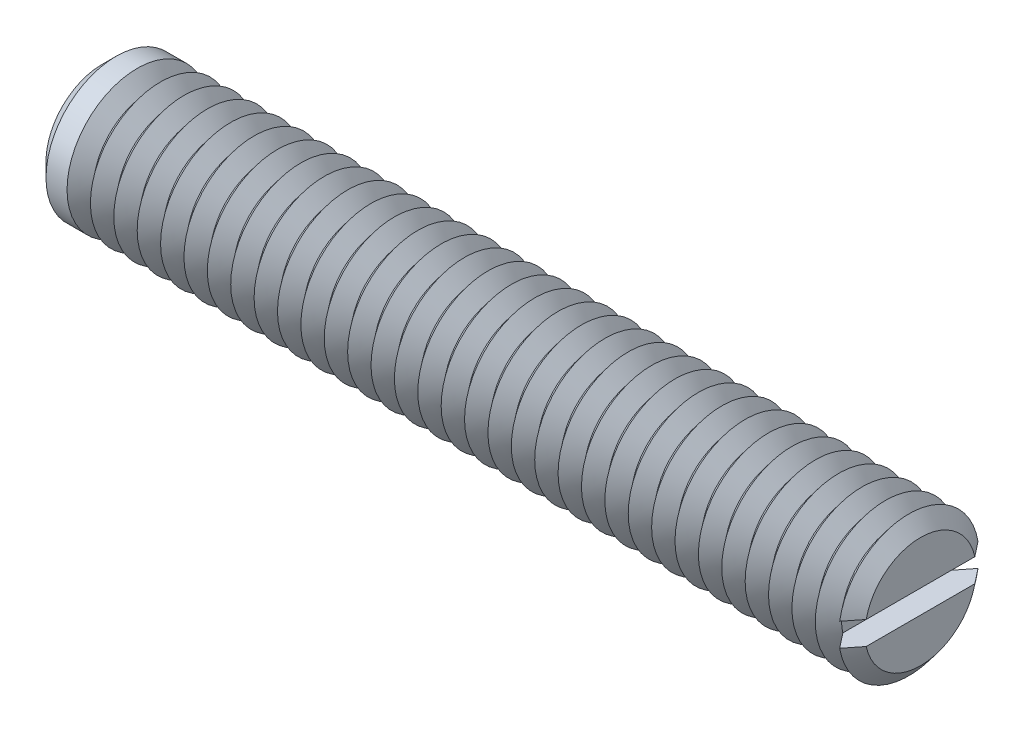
ISO-10303-21;
HEADER;
FILE_DESCRIPTION(('STEP AP214'),'2;1');
FILE_NAME('part.step','',(''),(''),'','','');
FILE_SCHEMA(('AUTOMOTIVE_DESIGN { 1 0 10303 214 1 1 1 1 }'));
ENDSEC;
DATA;
#1=APPLICATION_CONTEXT('core data for automotive mechanical design processes');
#2=APPLICATION_PROTOCOL_DEFINITION('international standard','automotive_design',2000,#1);
#3=PRODUCT_CONTEXT('',#1,'mechanical');
#4=PRODUCT('Part','Part','',(#3));
#5=PRODUCT_RELATED_PRODUCT_CATEGORY('part','',(#4));
#6=PRODUCT_DEFINITION_FORMATION('','',#4);
#7=PRODUCT_DEFINITION_CONTEXT('part definition',#1,'design');
#8=PRODUCT_DEFINITION('design','',#6,#7);
#9=PRODUCT_DEFINITION_SHAPE('','',#8);
#10=(LENGTH_UNIT() NAMED_UNIT(*) SI_UNIT(.MILLI.,.METRE.));
#11=(NAMED_UNIT(*) PLANE_ANGLE_UNIT() SI_UNIT($,.RADIAN.));
#12=(NAMED_UNIT(*) SI_UNIT($,.STERADIAN.) SOLID_ANGLE_UNIT());
#13=UNCERTAINTY_MEASURE_WITH_UNIT(LENGTH_MEASURE(1.E-05),#10,'distance_accuracy_value','');
#14=(GEOMETRIC_REPRESENTATION_CONTEXT(3) GLOBAL_UNCERTAINTY_ASSIGNED_CONTEXT((#13)) GLOBAL_UNIT_ASSIGNED_CONTEXT((#10,
#11,#12)) REPRESENTATION_CONTEXT('',''));
#15=CARTESIAN_POINT('',(0.,0.,0.));
#16=DIRECTION('',(0.,0.,1.));
#17=DIRECTION('',(1.,0.,0.));
#18=AXIS2_PLACEMENT_3D('',#15,#16,#17);
#19=CARTESIAN_POINT('',(17.,0.,0.));
#20=DIRECTION('',(1.,0.,0.));
#21=DIRECTION('',(0.,0.,-1.));
#22=AXIS2_PLACEMENT_3D('',#19,#20,#21);
#23=CONICAL_SURFACE('',#22,3.,0.895664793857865);
#24=CARTESIAN_POINT('',(17.,0.,0.));
#25=DIRECTION('',(-1.,0.,0.));
#26=DIRECTION('',(0.,0.,1.));
#27=AXIS2_PLACEMENT_3D('',#24,#25,#26);
#28=CIRCLE('',#27,3.);
#29=CARTESIAN_POINT('',(17.,-0.5,-2.95803989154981));
#30=VERTEX_POINT('',#29);
#31=CARTESIAN_POINT('',(17.,-0.5,2.95803989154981));
#32=VERTEX_POINT('',#31);
#33=EDGE_CURVE('E117',#30,#32,#28,.T.);
#34=ORIENTED_EDGE('',*,*,#33,.T.);
#35=CARTESIAN_POINT('',(19.8340158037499,-0.5,-6.52054251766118));
#36=CARTESIAN_POINT('',(19.6513674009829,-0.5,-6.29173953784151));
#37=CARTESIAN_POINT('',(19.4687482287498,-0.5,-6.06291320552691));
#38=CARTESIAN_POINT('',(19.1035782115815,-0.5,-5.60514706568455));
#39=CARTESIAN_POINT('',(18.9210273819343,-0.5,-5.376207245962));
#40=CARTESIAN_POINT('',(18.5555297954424,-0.5,-4.9175522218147));
#41=CARTESIAN_POINT('',(18.3725834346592,-0.5,-4.68783670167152));
#42=CARTESIAN_POINT('',(18.0069310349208,-0.5,-4.22827290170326));
#43=CARTESIAN_POINT('',(17.8242249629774,-0.5,-3.99842464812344));
#44=CARTESIAN_POINT('',(17.4431833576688,-0.5,-3.51834247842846));
#45=CARTESIAN_POINT('',(17.2448786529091,-0.5,-3.26808406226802));
#46=CARTESIAN_POINT('',(16.9479597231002,-0.5,-2.89216906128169));
#47=CARTESIAN_POINT('',(16.8490516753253,-0.5,-2.76674461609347));
#48=CARTESIAN_POINT('',(16.6515374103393,-0.5,-2.5156708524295));
#49=CARTESIAN_POINT('',(16.5529311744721,-0.5,-2.39002154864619));
#50=CARTESIAN_POINT('',(16.3563868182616,-0.5,-2.13862277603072));
#51=CARTESIAN_POINT('',(16.2584477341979,-0.5,-2.01287406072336));
#52=CARTESIAN_POINT('',(16.0633111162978,-0.5,-1.76075275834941));
#53=CARTESIAN_POINT('',(15.9661137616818,-0.5,-1.63438003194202));
#54=CARTESIAN_POINT('',(15.8214734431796,-0.5,-1.4440341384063));
#55=CARTESIAN_POINT('',(15.7734745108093,-0.5,-1.38048388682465));
#56=CARTESIAN_POINT('',(15.6780284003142,-0.5,-1.25297092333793));
#57=CARTESIAN_POINT('',(15.630581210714,-0.5,-1.18900822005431));
#58=CARTESIAN_POINT('',(15.5365530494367,-0.5,-1.0604855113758));
#59=CARTESIAN_POINT('',(15.4899717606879,-0.5,-0.995925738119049));
#60=CARTESIAN_POINT('',(15.3981961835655,-0.5,-0.86582992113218));
#61=CARTESIAN_POINT('',(15.3530016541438,-0.5,-0.800294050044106));
#62=CARTESIAN_POINT('',(15.2995678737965,-0.5,-0.719528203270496));
#63=CARTESIAN_POINT('',(15.2901114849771,-0.5,-0.705104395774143));
#64=CARTESIAN_POINT('',(15.2713420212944,-0.5,-0.676163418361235));
#65=CARTESIAN_POINT('',(15.262028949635,-0.5,-0.661646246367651));
#66=CARTESIAN_POINT('',(15.2343355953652,-0.5,-0.617935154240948));
#67=CARTESIAN_POINT('',(15.2162024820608,-0.5,-0.588583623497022));
#68=CARTESIAN_POINT('',(15.1808134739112,-0.5,-0.529281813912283));
#69=CARTESIAN_POINT('',(15.1635591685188,-0.5,-0.499330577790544));
#70=CARTESIAN_POINT('',(15.130358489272,-0.5,-0.438714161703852));
#71=CARTESIAN_POINT('',(15.1144119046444,-0.5,-0.408049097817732));
#72=CARTESIAN_POINT('',(15.0785841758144,-0.5,-0.333745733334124));
#73=CARTESIAN_POINT('',(15.0595664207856,-0.5,-0.289676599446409));
#74=CARTESIAN_POINT('',(15.0278600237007,-0.5,-0.199412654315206));
#75=CARTESIAN_POINT('',(15.0151365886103,-0.5,-0.153231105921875));
#76=CARTESIAN_POINT('',(15.001111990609,-0.5,-0.0687562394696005));
#77=CARTESIAN_POINT('',(14.998005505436,-0.5,-0.0307838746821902));
#78=CARTESIAN_POINT('',(14.9988722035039,-0.5,0.0450573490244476));
#79=CARTESIAN_POINT('',(15.0028411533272,-0.5,0.0829262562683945));
#80=CARTESIAN_POINT('',(15.0147515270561,-0.5,0.146691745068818));
#81=CARTESIAN_POINT('',(15.0212166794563,-0.5,0.172890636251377));
#82=CARTESIAN_POINT('',(15.0365108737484,-0.5,0.224599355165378));
#83=CARTESIAN_POINT('',(15.0453416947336,-0.5,0.250108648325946));
#84=CARTESIAN_POINT('',(15.0648480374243,-0.5,0.300632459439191));
#85=CARTESIAN_POINT('',(15.0755378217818,-0.5,0.325641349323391));
#86=CARTESIAN_POINT('',(15.098235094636,-0.5,0.375035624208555));
#87=CARTESIAN_POINT('',(15.1102421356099,-0.5,0.39942121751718));
#88=CARTESIAN_POINT('',(15.1509435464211,-0.5,0.478106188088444));
#89=CARTESIAN_POINT('',(15.1816009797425,-0.5,0.5313809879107));
#90=CARTESIAN_POINT('',(15.2454790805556,-0.5,0.636383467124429));
#91=CARTESIAN_POINT('',(15.2787021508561,-0.5,0.688109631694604));
#92=CARTESIAN_POINT('',(15.3467342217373,-0.5,0.790686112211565));
#93=CARTESIAN_POINT('',(15.3815468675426,-0.5,0.841534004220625));
#94=CARTESIAN_POINT('',(15.4520982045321,-0.5,0.942545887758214));
#95=CARTESIAN_POINT('',(15.4878365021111,-0.5,0.992710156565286));
#96=CARTESIAN_POINT('',(15.5600131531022,-0.5,1.09268759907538));
#97=CARTESIAN_POINT('',(15.596452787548,-0.5,1.14249984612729));
#98=CARTESIAN_POINT('',(15.6697745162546,-0.5,1.24180476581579));
#99=CARTESIAN_POINT('',(15.7066566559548,-0.5,1.29129740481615));
#100=CARTESIAN_POINT('',(15.8176541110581,-0.5,1.43926830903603));
#101=CARTESIAN_POINT('',(15.8922352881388,-0.5,1.5373967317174));
#102=CARTESIAN_POINT('',(16.047080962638,-0.5,1.73962858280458));
#103=CARTESIAN_POINT('',(16.1273934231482,-0.5,1.8436951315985));
#104=CARTESIAN_POINT('',(16.2885076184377,-0.5,2.05144913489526));
#105=CARTESIAN_POINT('',(16.3693093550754,-0.5,2.15513658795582));
#106=CARTESIAN_POINT('',(16.6121843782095,-0.5,2.46584176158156));
#107=CARTESIAN_POINT('',(16.7747224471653,-0.5,2.67249578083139));
#108=CARTESIAN_POINT('',(17.1005180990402,-0.5,3.08548885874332));
#109=CARTESIAN_POINT('',(17.2637761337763,-0.5,3.29182756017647));
#110=CARTESIAN_POINT('',(17.5906371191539,-0.5,3.70422676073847));
#111=CARTESIAN_POINT('',(17.7542400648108,-0.5,3.91028726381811));
#112=CARTESIAN_POINT('',(18.0774242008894,-0.5,4.31690950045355));
#113=CARTESIAN_POINT('',(18.2369999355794,-0.5,4.51747557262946));
#114=CARTESIAN_POINT('',(18.5562886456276,-0.5,4.91850000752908));
#115=CARTESIAN_POINT('',(18.7160016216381,-0.5,5.11895836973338));
#116=CARTESIAN_POINT('',(19.0353926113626,-0.5,5.51963619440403));
#117=CARTESIAN_POINT('',(19.1950705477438,-0.5,5.71985571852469));
#118=CARTESIAN_POINT('',(19.5144964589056,-0.5,6.12023723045));
#119=CARTESIAN_POINT('',(19.6742444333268,-0.5,6.32039921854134));
#120=CARTESIAN_POINT('',(19.8340158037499,-0.5,6.52054251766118));
#121=B_SPLINE_CURVE_WITH_KNOTS('',3,(#35,#36,#37,#38,#39,#40,#41,#42,#43,#44,#45,#46,#47,#48,
#49,#50,#51,#52,#53,#54,#55,#56,#57,#58,#59,#60,#61,#62,#63,#64,#65,#66,#67,#68,#69,#70,#71,#72,
#73,#74,#75,#76,#77,#78,#79,#80,#81,#82,#83,#84,#85,#86,#87,#88,#89,#90,#91,#92,#93,#94,#95,#96,
#97,#98,#99,#100,#101,#102,#103,#104,#105,#106,#107,#108,#109,#110,#111,#112,#113,#114,#115,
#116,#117,#118,#119,#120),.UNSPECIFIED.,.F.,.F.,(4,2,2,2,2,2,2,2,2,2,2,2,2,2,2,2,2,2,2,2,2,2,2,
2,2,2,2,2,2,2,2,2,2,2,2,2,2,2,2,2,2,2,4),(0.,0.878294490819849,1.75672728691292,
2.63771941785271,3.51857435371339,4.47648054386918,4.95567426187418,5.43483773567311,
5.91300334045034,6.39128103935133,6.63019943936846,6.86911286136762,7.10793700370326,
7.34671939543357,7.39846053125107,7.45020282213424,7.5536944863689,7.65736712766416,
7.76102302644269,7.9047661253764,8.04770552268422,8.16137782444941,8.27498213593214,
8.35581399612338,8.43670681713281,8.51825011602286,8.59976579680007,8.78399479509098,
8.96839847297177,9.15324864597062,9.33802146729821,9.52317177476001,9.70834126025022,
10.0780963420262,10.472454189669,10.8668135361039,11.65555692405,12.4448978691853,
13.2342274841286,14.0031360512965,14.7720482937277,15.5403347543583,16.3086173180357),.UNSPECIFIED.);
#122=CARTESIAN_POINT('',(16.5,-0.5,2.32228361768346));
#123=VERTEX_POINT('',#122);
#124=EDGE_CURVE('E109',#123,#32,#121,.T.);
#125=ORIENTED_EDGE('',*,*,#124,.F.);
#126=CARTESIAN_POINT('',(16.5,0.,0.));
#127=DIRECTION('',(-1.,0.,0.));
#128=DIRECTION('',(0.,0.,1.));
#129=AXIS2_PLACEMENT_3D('',#126,#127,#128);
#130=CIRCLE('',#129,2.37550020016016);
#131=CARTESIAN_POINT('',(16.5,-0.5,-2.32228361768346));
#132=VERTEX_POINT('',#131);
#133=EDGE_CURVE('E487',#132,#123,#130,.T.);
#134=ORIENTED_EDGE('',*,*,#133,.F.);
#135=EDGE_CURVE('E58',#30,#132,#121,.T.);
#136=ORIENTED_EDGE('',*,*,#135,.F.);
#137=EDGE_LOOP('',(#34,#125,#134,#136));
#138=FACE_BOUND('',#137,.T.);
#139=ADVANCED_FACE('F37',(#138),#23,.T.);
#140=CARTESIAN_POINT('',(17.,0.5,2.95803989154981));
#141=VERTEX_POINT('',#140);
#142=CARTESIAN_POINT('',(17.,0.5,-2.95803989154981));
#143=VERTEX_POINT('',#142);
#144=EDGE_CURVE('E100',#141,#143,#28,.T.);
#145=ORIENTED_EDGE('',*,*,#144,.T.);
#146=CARTESIAN_POINT('',(19.8340158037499,0.5,6.52054251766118));
#147=CARTESIAN_POINT('',(19.6513674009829,0.5,6.29173953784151));
#148=CARTESIAN_POINT('',(19.4687482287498,0.5,6.06291320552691));
#149=CARTESIAN_POINT('',(19.1035782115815,0.5,5.60514706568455));
#150=CARTESIAN_POINT('',(18.9210273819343,0.5,5.376207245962));
#151=CARTESIAN_POINT('',(18.5555297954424,0.5,4.9175522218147));
#152=CARTESIAN_POINT('',(18.3725834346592,0.5,4.68783670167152));
#153=CARTESIAN_POINT('',(18.0069310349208,0.5,4.22827290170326));
#154=CARTESIAN_POINT('',(17.8242249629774,0.5,3.99842464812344));
#155=CARTESIAN_POINT('',(17.4431833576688,0.5,3.51834247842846));
#156=CARTESIAN_POINT('',(17.2448786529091,0.5,3.26808406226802));
#157=CARTESIAN_POINT('',(16.9479597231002,0.5,2.89216906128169));
#158=CARTESIAN_POINT('',(16.8490516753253,0.5,2.76674461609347));
#159=CARTESIAN_POINT('',(16.6515374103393,0.5,2.5156708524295));
#160=CARTESIAN_POINT('',(16.5529311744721,0.5,2.39002154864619));
#161=CARTESIAN_POINT('',(16.3563868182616,0.5,2.13862277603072));
#162=CARTESIAN_POINT('',(16.2584477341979,0.5,2.01287406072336));
#163=CARTESIAN_POINT('',(16.0633111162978,0.5,1.76075275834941));
#164=CARTESIAN_POINT('',(15.9661137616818,0.5,1.63438003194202));
#165=CARTESIAN_POINT('',(15.8214734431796,0.5,1.4440341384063));
#166=CARTESIAN_POINT('',(15.7734745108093,0.5,1.38048388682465));
#167=CARTESIAN_POINT('',(15.6780284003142,0.5,1.25297092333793));
#168=CARTESIAN_POINT('',(15.630581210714,0.5,1.18900822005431));
#169=CARTESIAN_POINT('',(15.5365530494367,0.5,1.0604855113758));
#170=CARTESIAN_POINT('',(15.4899717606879,0.5,0.995925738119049));
#171=CARTESIAN_POINT('',(15.3981961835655,0.5,0.86582992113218));
#172=CARTESIAN_POINT('',(15.3530016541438,0.5,0.800294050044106));
#173=CARTESIAN_POINT('',(15.2995678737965,0.5,0.719528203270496));
#174=CARTESIAN_POINT('',(15.2901114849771,0.5,0.705104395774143));
#175=CARTESIAN_POINT('',(15.2713420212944,0.5,0.676163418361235));
#176=CARTESIAN_POINT('',(15.262028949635,0.5,0.661646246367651));
#177=CARTESIAN_POINT('',(15.2343355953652,0.5,0.617935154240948));
#178=CARTESIAN_POINT('',(15.2162024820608,0.5,0.588583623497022));
#179=CARTESIAN_POINT('',(15.1808134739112,0.5,0.529281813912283));
#180=CARTESIAN_POINT('',(15.1635591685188,0.5,0.499330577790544));
#181=CARTESIAN_POINT('',(15.130358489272,0.5,0.438714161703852));
#182=CARTESIAN_POINT('',(15.1144119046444,0.5,0.408049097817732));
#183=CARTESIAN_POINT('',(15.0785841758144,0.5,0.333745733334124));
#184=CARTESIAN_POINT('',(15.0595664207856,0.5,0.289676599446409));
#185=CARTESIAN_POINT('',(15.0278600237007,0.5,0.199412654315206));
#186=CARTESIAN_POINT('',(15.0151365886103,0.5,0.153231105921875));
#187=CARTESIAN_POINT('',(15.001111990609,0.5,0.0687562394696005));
#188=CARTESIAN_POINT('',(14.998005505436,0.5,0.0307838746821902));
#189=CARTESIAN_POINT('',(14.9988722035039,0.5,-0.0450573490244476));
#190=CARTESIAN_POINT('',(15.0028411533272,0.5,-0.0829262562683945));
#191=CARTESIAN_POINT('',(15.0147515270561,0.5,-0.146691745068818));
#192=CARTESIAN_POINT('',(15.0212166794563,0.5,-0.172890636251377));
#193=CARTESIAN_POINT('',(15.0365108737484,0.5,-0.224599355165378));
#194=CARTESIAN_POINT('',(15.0453416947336,0.5,-0.250108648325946));
#195=CARTESIAN_POINT('',(15.0648480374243,0.5,-0.300632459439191));
#196=CARTESIAN_POINT('',(15.0755378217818,0.5,-0.325641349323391));
#197=CARTESIAN_POINT('',(15.098235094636,0.5,-0.375035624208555));
#198=CARTESIAN_POINT('',(15.1102421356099,0.5,-0.39942121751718));
#199=CARTESIAN_POINT('',(15.1509435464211,0.5,-0.478106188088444));
#200=CARTESIAN_POINT('',(15.1816009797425,0.5,-0.5313809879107));
#201=CARTESIAN_POINT('',(15.2454790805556,0.5,-0.636383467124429));
#202=CARTESIAN_POINT('',(15.2787021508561,0.5,-0.688109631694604));
#203=CARTESIAN_POINT('',(15.3467342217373,0.5,-0.790686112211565));
#204=CARTESIAN_POINT('',(15.3815468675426,0.5,-0.841534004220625));
#205=CARTESIAN_POINT('',(15.4520982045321,0.5,-0.942545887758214));
#206=CARTESIAN_POINT('',(15.4878365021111,0.5,-0.992710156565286));
#207=CARTESIAN_POINT('',(15.5600131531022,0.5,-1.09268759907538));
#208=CARTESIAN_POINT('',(15.596452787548,0.5,-1.14249984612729));
#209=CARTESIAN_POINT('',(15.6697745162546,0.5,-1.24180476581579));
#210=CARTESIAN_POINT('',(15.7066566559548,0.5,-1.29129740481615));
#211=CARTESIAN_POINT('',(15.8176541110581,0.5,-1.43926830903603));
#212=CARTESIAN_POINT('',(15.8922352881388,0.5,-1.5373967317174));
#213=CARTESIAN_POINT('',(16.047080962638,0.5,-1.73962858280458));
#214=CARTESIAN_POINT('',(16.1273934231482,0.5,-1.8436951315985));
#215=CARTESIAN_POINT('',(16.2885076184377,0.5,-2.05144913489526));
#216=CARTESIAN_POINT('',(16.3693093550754,0.5,-2.15513658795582));
#217=CARTESIAN_POINT('',(16.6121843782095,0.5,-2.46584176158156));
#218=CARTESIAN_POINT('',(16.7747224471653,0.5,-2.67249578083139));
#219=CARTESIAN_POINT('',(17.1005180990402,0.5,-3.08548885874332));
#220=CARTESIAN_POINT('',(17.2637761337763,0.5,-3.29182756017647));
#221=CARTESIAN_POINT('',(17.5906371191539,0.5,-3.70422676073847));
#222=CARTESIAN_POINT('',(17.7542400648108,0.5,-3.91028726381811));
#223=CARTESIAN_POINT('',(18.0774242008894,0.5,-4.31690950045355));
#224=CARTESIAN_POINT('',(18.2369999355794,0.5,-4.51747557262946));
#225=CARTESIAN_POINT('',(18.5562886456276,0.5,-4.91850000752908));
#226=CARTESIAN_POINT('',(18.7160016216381,0.5,-5.11895836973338));
#227=CARTESIAN_POINT('',(19.0353926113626,0.5,-5.51963619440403));
#228=CARTESIAN_POINT('',(19.1950705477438,0.5,-5.71985571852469));
#229=CARTESIAN_POINT('',(19.5144964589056,0.5,-6.12023723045));
#230=CARTESIAN_POINT('',(19.6742444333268,0.5,-6.32039921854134));
#231=CARTESIAN_POINT('',(19.8340158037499,0.5,-6.52054251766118));
#232=B_SPLINE_CURVE_WITH_KNOTS('',3,(#146,#147,#148,#149,#150,#151,#152,#153,#154,#155,#156,
#157,#158,#159,#160,#161,#162,#163,#164,#165,#166,#167,#168,#169,#170,#171,#172,#173,#174,#175,
#176,#177,#178,#179,#180,#181,#182,#183,#184,#185,#186,#187,#188,#189,#190,#191,#192,#193,#194,
#195,#196,#197,#198,#199,#200,#201,#202,#203,#204,#205,#206,#207,#208,#209,#210,#211,#212,#213,
#214,#215,#216,#217,#218,#219,#220,#221,#222,#223,#224,#225,#226,#227,#228,#229,#230,#231),
.UNSPECIFIED.,.F.,.F.,(4,2,2,2,2,2,2,2,2,2,2,2,2,2,2,2,2,2,2,2,2,2,2,2,2,2,2,2,2,2,2,2,2,2,2,2,
2,2,2,2,2,2,4),(0.,0.878294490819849,1.75672728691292,2.63771941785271,3.51857435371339,
4.47648054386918,4.95567426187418,5.43483773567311,5.91300334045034,6.39128103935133,
6.63019943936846,6.86911286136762,7.10793700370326,7.34671939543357,7.39846053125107,
7.45020282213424,7.5536944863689,7.65736712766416,7.76102302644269,7.9047661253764,
8.04770552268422,8.16137782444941,8.27498213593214,8.35581399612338,8.43670681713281,
8.51825011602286,8.59976579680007,8.78399479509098,8.96839847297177,9.15324864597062,
9.33802146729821,9.52317177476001,9.70834126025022,10.0780963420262,10.472454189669,
10.8668135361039,11.65555692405,12.4448978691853,13.2342274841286,14.0031360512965,
14.7720482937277,15.5403347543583,16.3086173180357),.UNSPECIFIED.);
#233=CARTESIAN_POINT('',(16.5,0.5,-2.32228361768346));
#234=VERTEX_POINT('',#233);
#235=EDGE_CURVE('E110',#234,#143,#232,.T.);
#236=ORIENTED_EDGE('',*,*,#235,.F.);
#237=CARTESIAN_POINT('',(16.5,0.5,2.32228361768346));
#238=VERTEX_POINT('',#237);
#239=EDGE_CURVE('E103',#238,#234,#130,.T.);
#240=ORIENTED_EDGE('',*,*,#239,.F.);
#241=EDGE_CURVE('E97',#141,#238,#232,.T.);
#242=ORIENTED_EDGE('',*,*,#241,.F.);
#243=EDGE_LOOP('',(#145,#236,#240,#242));
#244=FACE_BOUND('',#243,.T.);
#245=ADVANCED_FACE('F99',(#244),#23,.T.);
#246=CARTESIAN_POINT('',(16.5,0.,0.));
#247=DIRECTION('',(-1.,0.,0.));
#248=DIRECTION('',(0.,0.,1.));
#249=AXIS2_PLACEMENT_3D('',#246,#247,#248);
#250=CONICAL_SURFACE('',#249,2.37550020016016,0.895664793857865);
#251=CARTESIAN_POINT('',(16.,0.,0.));
#252=DIRECTION('',(-1.,0.,0.));
#253=DIRECTION('',(0.,0.,1.));
#254=AXIS2_PLACEMENT_3D('',#251,#252,#253);
#255=CIRCLE('',#254,3.);
#256=CARTESIAN_POINT('',(16.,0.,3.));
#257=VERTEX_POINT('',#256);
#258=EDGE_CURVE('E473',#257,#257,#255,.T.);
#259=ORIENTED_EDGE('',*,*,#258,.F.);
#260=EDGE_LOOP('',(#259));
#261=FACE_BOUND('',#260,.T.);
#262=ORIENTED_EDGE('',*,*,#239,.T.);
#263=EDGE_CURVE('E482',#234,#132,#130,.T.);
#264=ORIENTED_EDGE('',*,*,#263,.T.);
#265=ORIENTED_EDGE('',*,*,#133,.T.);
#266=EDGE_CURVE('E480',#123,#238,#130,.T.);
#267=ORIENTED_EDGE('',*,*,#266,.T.);
#268=EDGE_LOOP('',(#262,#264,#265,#267));
#269=FACE_BOUND('',#268,.T.);
#270=ADVANCED_FACE('F168',(#261,#269),#250,.T.);
#271=CARTESIAN_POINT('',(17.5,0.,0.));
#272=DIRECTION('',(1.,0.,0.));
#273=DIRECTION('',(0.,0.,-1.));
#274=AXIS2_PLACEMENT_3D('',#271,#272,#273);
#275=PLANE('',#274);
#276=CARTESIAN_POINT('',(17.5,0.,0.));
#277=DIRECTION('',(-1.,0.,0.));
#278=DIRECTION('',(0.,0.,1.));
#279=AXIS2_PLACEMENT_3D('',#276,#277,#278);
#280=CIRCLE('',#279,2.37550020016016);
#281=CARTESIAN_POINT('',(17.5,0.5,2.32228361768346));
#282=VERTEX_POINT('',#281);
#283=CARTESIAN_POINT('',(17.5,0.5,-2.32228361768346));
#284=VERTEX_POINT('',#283);
#285=EDGE_CURVE('E160',#282,#284,#280,.T.);
#286=ORIENTED_EDGE('',*,*,#285,.F.);
#287=DIRECTION('',(0.,0.,1.));
#288=VECTOR('',#287,1.);
#289=CARTESIAN_POINT('',(17.5,0.5,0.));
#290=LINE('',#289,#288);
#291=EDGE_CURVE('E122',#284,#282,#290,.T.);
#292=ORIENTED_EDGE('',*,*,#291,.F.);
#293=EDGE_LOOP('',(#286,#292));
#294=FACE_BOUND('',#293,.T.);
#295=ADVANCED_FACE('F172',(#294),#275,.T.);
#296=CARTESIAN_POINT('',(17.5,-0.5,-2.32228361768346));
#297=VERTEX_POINT('',#296);
#298=CARTESIAN_POINT('',(17.5,-0.5,2.32228361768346));
#299=VERTEX_POINT('',#298);
#300=EDGE_CURVE('E66',#297,#299,#280,.T.);
#301=ORIENTED_EDGE('',*,*,#300,.F.);
#302=DIRECTION('',(0.,0.,-1.));
#303=VECTOR('',#302,1.);
#304=CARTESIAN_POINT('',(17.5,-0.5,0.));
#305=LINE('',#304,#303);
#306=EDGE_CURVE('E136',#299,#297,#305,.T.);
#307=ORIENTED_EDGE('',*,*,#306,.F.);
#308=EDGE_LOOP('',(#301,#307));
#309=FACE_BOUND('',#308,.T.);
#310=ADVANCED_FACE('F203',(#309),#275,.T.);
#311=CARTESIAN_POINT('',(17.5,0.,0.));
#312=DIRECTION('',(-1.,0.,0.));
#313=DIRECTION('',(0.,0.,1.));
#314=AXIS2_PLACEMENT_3D('',#311,#312,#313);
#315=CONICAL_SURFACE('',#314,2.37550020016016,0.895664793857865);
#316=ORIENTED_EDGE('',*,*,#144,.F.);
#317=CARTESIAN_POINT('',(14.1659841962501,0.5,-6.52054251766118));
#318=CARTESIAN_POINT('',(14.3486325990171,0.5,-6.29173953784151));
#319=CARTESIAN_POINT('',(14.5312517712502,0.5,-6.06291320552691));
#320=CARTESIAN_POINT('',(14.8964217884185,0.5,-5.60514706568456));
#321=CARTESIAN_POINT('',(15.0789726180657,0.5,-5.37620724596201));
#322=CARTESIAN_POINT('',(15.4444702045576,0.5,-4.91755222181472));
#323=CARTESIAN_POINT('',(15.6274165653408,0.5,-4.68783670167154));
#324=CARTESIAN_POINT('',(15.9930689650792,0.5,-4.22827290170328));
#325=CARTESIAN_POINT('',(16.1757750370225,0.5,-3.99842464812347));
#326=CARTESIAN_POINT('',(16.5568166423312,0.5,-3.51834247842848));
#327=CARTESIAN_POINT('',(16.7551213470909,0.5,-3.26808406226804));
#328=CARTESIAN_POINT('',(17.0520402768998,0.5,-2.89216906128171));
#329=CARTESIAN_POINT('',(17.1509483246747,0.5,-2.76674461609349));
#330=CARTESIAN_POINT('',(17.3484625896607,0.5,-2.51567085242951));
#331=CARTESIAN_POINT('',(17.4470688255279,0.5,-2.39002154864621));
#332=CARTESIAN_POINT('',(17.6436131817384,0.5,-2.13862277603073));
#333=CARTESIAN_POINT('',(17.7415522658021,0.5,-2.01287406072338));
#334=CARTESIAN_POINT('',(17.9366888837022,0.5,-1.76075275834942));
#335=CARTESIAN_POINT('',(18.0338862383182,0.5,-1.63438003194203));
#336=CARTESIAN_POINT('',(18.1785265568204,0.5,-1.4440341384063));
#337=CARTESIAN_POINT('',(18.2265254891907,0.5,-1.38048388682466));
#338=CARTESIAN_POINT('',(18.3219715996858,0.5,-1.25297092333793));
#339=CARTESIAN_POINT('',(18.369418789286,0.5,-1.18900822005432));
#340=CARTESIAN_POINT('',(18.4634469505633,0.5,-1.06048551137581));
#341=CARTESIAN_POINT('',(18.5100282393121,0.5,-0.995925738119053));
#342=CARTESIAN_POINT('',(18.6018038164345,0.5,-0.865829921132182));
#343=CARTESIAN_POINT('',(18.6469983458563,0.5,-0.800294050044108));
#344=CARTESIAN_POINT('',(18.7004321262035,0.5,-0.719528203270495));
#345=CARTESIAN_POINT('',(18.7098885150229,0.5,-0.705104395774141));
#346=CARTESIAN_POINT('',(18.7286579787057,0.5,-0.676163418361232));
#347=CARTESIAN_POINT('',(18.737971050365,0.5,-0.661646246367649));
#348=CARTESIAN_POINT('',(18.7656644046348,0.5,-0.617935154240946));
#349=CARTESIAN_POINT('',(18.7837975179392,0.5,-0.588583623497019));
#350=CARTESIAN_POINT('',(18.8191865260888,0.5,-0.529281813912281));
#351=CARTESIAN_POINT('',(18.8364408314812,0.5,-0.499330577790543));
#352=CARTESIAN_POINT('',(18.869641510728,0.5,-0.438714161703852));
#353=CARTESIAN_POINT('',(18.8855880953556,0.5,-0.408049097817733));
#354=CARTESIAN_POINT('',(18.9214158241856,0.5,-0.333745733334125));
#355=CARTESIAN_POINT('',(18.9404335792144,0.5,-0.289676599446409));
#356=CARTESIAN_POINT('',(18.9721399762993,0.5,-0.199412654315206));
#357=CARTESIAN_POINT('',(18.9848634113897,0.5,-0.153231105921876));
#358=CARTESIAN_POINT('',(18.998888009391,0.5,-0.0687562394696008));
#359=CARTESIAN_POINT('',(19.001994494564,0.5,-0.0307838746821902));
#360=CARTESIAN_POINT('',(19.0011277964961,0.5,0.0450573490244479));
#361=CARTESIAN_POINT('',(18.9971588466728,0.5,0.0829262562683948));
#362=CARTESIAN_POINT('',(18.9852484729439,0.5,0.146691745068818));
#363=CARTESIAN_POINT('',(18.9787833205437,0.5,0.172890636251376));
#364=CARTESIAN_POINT('',(18.9634891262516,0.5,0.224599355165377));
#365=CARTESIAN_POINT('',(18.9546583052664,0.5,0.250108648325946));
#366=CARTESIAN_POINT('',(18.9351519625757,0.5,0.300632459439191));
#367=CARTESIAN_POINT('',(18.9244621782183,0.5,0.325641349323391));
#368=CARTESIAN_POINT('',(18.901764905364,0.5,0.375035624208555));
#369=CARTESIAN_POINT('',(18.8897578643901,0.5,0.39942121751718));
#370=CARTESIAN_POINT('',(18.8490564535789,0.5,0.478106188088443));
#371=CARTESIAN_POINT('',(18.8183990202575,0.5,0.5313809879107));
#372=CARTESIAN_POINT('',(18.7545209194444,0.5,0.636383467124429));
#373=CARTESIAN_POINT('',(18.7212978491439,0.5,0.688109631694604));
#374=CARTESIAN_POINT('',(18.6532657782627,0.5,0.790686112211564));
#375=CARTESIAN_POINT('',(18.6184531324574,0.5,0.841534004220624));
#376=CARTESIAN_POINT('',(18.5479017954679,0.5,0.942545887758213));
#377=CARTESIAN_POINT('',(18.5121634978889,0.5,0.992710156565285));
#378=CARTESIAN_POINT('',(18.4399868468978,0.5,1.09268759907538));
#379=CARTESIAN_POINT('',(18.403547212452,0.5,1.14249984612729));
#380=CARTESIAN_POINT('',(18.3302254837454,0.5,1.24180476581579));
#381=CARTESIAN_POINT('',(18.2933433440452,0.5,1.29129740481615));
#382=CARTESIAN_POINT('',(18.1823458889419,0.5,1.43926830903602));
#383=CARTESIAN_POINT('',(18.1077647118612,0.5,1.5373967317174));
#384=CARTESIAN_POINT('',(17.952919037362,0.5,1.73962858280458));
#385=CARTESIAN_POINT('',(17.8726065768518,0.5,1.8436951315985));
#386=CARTESIAN_POINT('',(17.7114923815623,0.5,2.05144913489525));
#387=CARTESIAN_POINT('',(17.6306906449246,0.5,2.15513658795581));
#388=CARTESIAN_POINT('',(17.3878156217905,0.5,2.46584176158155));
#389=CARTESIAN_POINT('',(17.2252775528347,0.5,2.67249578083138));
#390=CARTESIAN_POINT('',(16.8994819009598,0.5,3.08548885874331));
#391=CARTESIAN_POINT('',(16.7362238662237,0.5,3.29182756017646));
#392=CARTESIAN_POINT('',(16.4093628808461,0.5,3.70422676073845));
#393=CARTESIAN_POINT('',(16.2457599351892,0.5,3.9102872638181));
#394=CARTESIAN_POINT('',(15.9225757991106,0.5,4.31690950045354));
#395=CARTESIAN_POINT('',(15.7630000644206,0.5,4.51747557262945));
#396=CARTESIAN_POINT('',(15.4437113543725,0.5,4.91850000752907));
#397=CARTESIAN_POINT('',(15.2839983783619,0.5,5.11895836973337));
#398=CARTESIAN_POINT('',(14.9646073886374,0.5,5.51963619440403));
#399=CARTESIAN_POINT('',(14.8049294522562,0.5,5.71985571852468));
#400=CARTESIAN_POINT('',(14.4855035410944,0.5,6.12023723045));
#401=CARTESIAN_POINT('',(14.3257555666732,0.5,6.32039921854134));
#402=CARTESIAN_POINT('',(14.1659841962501,0.5,6.52054251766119));
#403=B_SPLINE_CURVE_WITH_KNOTS('',3,(#317,#318,#319,#320,#321,#322,#323,#324,#325,#326,#327,
#328,#329,#330,#331,#332,#333,#334,#335,#336,#337,#338,#339,#340,#341,#342,#343,#344,#345,#346,
#347,#348,#349,#350,#351,#352,#353,#354,#355,#356,#357,#358,#359,#360,#361,#362,#363,#364,#365,
#366,#367,#368,#369,#370,#371,#372,#373,#374,#375,#376,#377,#378,#379,#380,#381,#382,#383,#384,
#385,#386,#387,#388,#389,#390,#391,#392,#393,#394,#395,#396,#397,#398,#399,#400,#401,#402),
.UNSPECIFIED.,.F.,.F.,(4,2,2,2,2,2,2,2,2,2,2,2,2,2,2,2,2,2,2,2,2,2,2,2,2,2,2,2,2,2,2,2,2,2,2,2,
2,2,2,2,2,2,4),(0.,0.878294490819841,1.7567272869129,2.63771941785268,3.51857435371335,
4.47648054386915,4.95567426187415,5.4348377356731,5.91300334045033,6.39128103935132,
6.63019943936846,6.86911286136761,7.10793700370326,7.34671939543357,7.39846053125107,
7.45020282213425,7.55369448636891,7.65736712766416,7.76102302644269,7.9047661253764,
8.04770552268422,8.16137782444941,8.27498213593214,8.35581399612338,8.43670681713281,
8.51825011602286,8.59976579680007,8.78399479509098,8.96839847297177,9.15324864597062,
9.33802146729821,9.52317177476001,9.70834126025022,10.0780963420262,10.472454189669,
10.8668135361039,11.65555692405,12.4448978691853,13.2342274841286,14.0031360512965,
14.7720482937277,15.5403347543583,16.3086173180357),.UNSPECIFIED.);
#404=EDGE_CURVE('E41',#282,#141,#403,.T.);
#405=ORIENTED_EDGE('',*,*,#404,.F.);
#406=ORIENTED_EDGE('',*,*,#285,.T.);
#407=EDGE_CURVE('E11',#143,#284,#403,.T.);
#408=ORIENTED_EDGE('',*,*,#407,.F.);
#409=EDGE_LOOP('',(#316,#405,#406,#408));
#410=FACE_BOUND('',#409,.T.);
#411=ADVANCED_FACE('F114',(#410),#315,.T.);
#412=CARTESIAN_POINT('',(17.5,0.5,-4.5));
#413=DIRECTION('',(0.,1.,0.));
#414=DIRECTION('',(0.,0.,1.));
#415=AXIS2_PLACEMENT_3D('',#412,#413,#414);
#416=PLANE('',#415);
#417=ORIENTED_EDGE('',*,*,#404,.T.);
#418=ORIENTED_EDGE('',*,*,#241,.T.);
#419=DIRECTION('',(0.,0.,1.));
#420=VECTOR('',#419,1.);
#421=CARTESIAN_POINT('',(16.5,0.5,-4.5));
#422=LINE('',#421,#420);
#423=EDGE_CURVE('E145',#234,#238,#422,.T.);
#424=ORIENTED_EDGE('',*,*,#423,.F.);
#425=ORIENTED_EDGE('',*,*,#235,.T.);
#426=ORIENTED_EDGE('',*,*,#407,.T.);
#427=ORIENTED_EDGE('',*,*,#291,.T.);
#428=EDGE_LOOP('',(#417,#418,#424,#425,#426,#427));
#429=FACE_BOUND('',#428,.T.);
#430=ADVANCED_FACE('F120',(#429),#416,.F.);
#431=ORIENTED_EDGE('',*,*,#33,.F.);
#432=CARTESIAN_POINT('',(14.1659841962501,-0.5,6.52054251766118));
#433=CARTESIAN_POINT('',(14.3486325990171,-0.5,6.29173953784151));
#434=CARTESIAN_POINT('',(14.5312517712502,-0.5,6.06291320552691));
#435=CARTESIAN_POINT('',(14.8964217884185,-0.5,5.60514706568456));
#436=CARTESIAN_POINT('',(15.0789726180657,-0.5,5.37620724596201));
#437=CARTESIAN_POINT('',(15.4444702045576,-0.5,4.91755222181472));
#438=CARTESIAN_POINT('',(15.6274165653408,-0.5,4.68783670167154));
#439=CARTESIAN_POINT('',(15.9930689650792,-0.5,4.22827290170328));
#440=CARTESIAN_POINT('',(16.1757750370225,-0.5,3.99842464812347));
#441=CARTESIAN_POINT('',(16.5568166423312,-0.5,3.51834247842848));
#442=CARTESIAN_POINT('',(16.7551213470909,-0.5,3.26808406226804));
#443=CARTESIAN_POINT('',(17.0520402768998,-0.5,2.89216906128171));
#444=CARTESIAN_POINT('',(17.1509483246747,-0.5,2.76674461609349));
#445=CARTESIAN_POINT('',(17.3484625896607,-0.5,2.51567085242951));
#446=CARTESIAN_POINT('',(17.4470688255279,-0.5,2.39002154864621));
#447=CARTESIAN_POINT('',(17.6436131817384,-0.5,2.13862277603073));
#448=CARTESIAN_POINT('',(17.7415522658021,-0.5,2.01287406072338));
#449=CARTESIAN_POINT('',(17.9366888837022,-0.5,1.76075275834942));
#450=CARTESIAN_POINT('',(18.0338862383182,-0.5,1.63438003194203));
#451=CARTESIAN_POINT('',(18.1785265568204,-0.5,1.4440341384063));
#452=CARTESIAN_POINT('',(18.2265254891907,-0.5,1.38048388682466));
#453=CARTESIAN_POINT('',(18.3219715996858,-0.5,1.25297092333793));
#454=CARTESIAN_POINT('',(18.369418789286,-0.5,1.18900822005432));
#455=CARTESIAN_POINT('',(18.4634469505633,-0.5,1.06048551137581));
#456=CARTESIAN_POINT('',(18.5100282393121,-0.5,0.995925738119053));
#457=CARTESIAN_POINT('',(18.6018038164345,-0.5,0.865829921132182));
#458=CARTESIAN_POINT('',(18.6469983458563,-0.5,0.800294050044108));
#459=CARTESIAN_POINT('',(18.7004321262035,-0.5,0.719528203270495));
#460=CARTESIAN_POINT('',(18.7098885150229,-0.5,0.705104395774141));
#461=CARTESIAN_POINT('',(18.7286579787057,-0.5,0.676163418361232));
#462=CARTESIAN_POINT('',(18.737971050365,-0.5,0.661646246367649));
#463=CARTESIAN_POINT('',(18.7656644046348,-0.5,0.617935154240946));
#464=CARTESIAN_POINT('',(18.7837975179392,-0.5,0.588583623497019));
#465=CARTESIAN_POINT('',(18.8191865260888,-0.5,0.529281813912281));
#466=CARTESIAN_POINT('',(18.8364408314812,-0.5,0.499330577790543));
#467=CARTESIAN_POINT('',(18.869641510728,-0.5,0.438714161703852));
#468=CARTESIAN_POINT('',(18.8855880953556,-0.5,0.408049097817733));
#469=CARTESIAN_POINT('',(18.9214158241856,-0.5,0.333745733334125));
#470=CARTESIAN_POINT('',(18.9404335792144,-0.5,0.289676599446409));
#471=CARTESIAN_POINT('',(18.9721399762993,-0.5,0.199412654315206));
#472=CARTESIAN_POINT('',(18.9848634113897,-0.5,0.153231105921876));
#473=CARTESIAN_POINT('',(18.998888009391,-0.5,0.0687562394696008));
#474=CARTESIAN_POINT('',(19.001994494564,-0.5,0.0307838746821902));
#475=CARTESIAN_POINT('',(19.0011277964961,-0.5,-0.0450573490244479));
#476=CARTESIAN_POINT('',(18.9971588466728,-0.5,-0.0829262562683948));
#477=CARTESIAN_POINT('',(18.9852484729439,-0.5,-0.146691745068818));
#478=CARTESIAN_POINT('',(18.9787833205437,-0.5,-0.172890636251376));
#479=CARTESIAN_POINT('',(18.9634891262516,-0.5,-0.224599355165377));
#480=CARTESIAN_POINT('',(18.9546583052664,-0.5,-0.250108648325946));
#481=CARTESIAN_POINT('',(18.9351519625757,-0.5,-0.300632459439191));
#482=CARTESIAN_POINT('',(18.9244621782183,-0.5,-0.325641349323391));
#483=CARTESIAN_POINT('',(18.901764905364,-0.5,-0.375035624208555));
#484=CARTESIAN_POINT('',(18.8897578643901,-0.5,-0.39942121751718));
#485=CARTESIAN_POINT('',(18.8490564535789,-0.5,-0.478106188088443));
#486=CARTESIAN_POINT('',(18.8183990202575,-0.5,-0.5313809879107));
#487=CARTESIAN_POINT('',(18.7545209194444,-0.5,-0.636383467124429));
#488=CARTESIAN_POINT('',(18.7212978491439,-0.5,-0.688109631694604));
#489=CARTESIAN_POINT('',(18.6532657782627,-0.5,-0.790686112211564));
#490=CARTESIAN_POINT('',(18.6184531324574,-0.5,-0.841534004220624));
#491=CARTESIAN_POINT('',(18.5479017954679,-0.5,-0.942545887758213));
#492=CARTESIAN_POINT('',(18.5121634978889,-0.5,-0.992710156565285));
#493=CARTESIAN_POINT('',(18.4399868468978,-0.5,-1.09268759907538));
#494=CARTESIAN_POINT('',(18.403547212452,-0.5,-1.14249984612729));
#495=CARTESIAN_POINT('',(18.3302254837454,-0.5,-1.24180476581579));
#496=CARTESIAN_POINT('',(18.2933433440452,-0.5,-1.29129740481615));
#497=CARTESIAN_POINT('',(18.1823458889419,-0.5,-1.43926830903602));
#498=CARTESIAN_POINT('',(18.1077647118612,-0.5,-1.5373967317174));
#499=CARTESIAN_POINT('',(17.952919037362,-0.5,-1.73962858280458));
#500=CARTESIAN_POINT('',(17.8726065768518,-0.5,-1.8436951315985));
#501=CARTESIAN_POINT('',(17.7114923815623,-0.5,-2.05144913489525));
#502=CARTESIAN_POINT('',(17.6306906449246,-0.5,-2.15513658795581));
#503=CARTESIAN_POINT('',(17.3878156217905,-0.5,-2.46584176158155));
#504=CARTESIAN_POINT('',(17.2252775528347,-0.5,-2.67249578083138));
#505=CARTESIAN_POINT('',(16.8994819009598,-0.5,-3.08548885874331));
#506=CARTESIAN_POINT('',(16.7362238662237,-0.5,-3.29182756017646));
#507=CARTESIAN_POINT('',(16.4093628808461,-0.5,-3.70422676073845));
#508=CARTESIAN_POINT('',(16.2457599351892,-0.5,-3.9102872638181));
#509=CARTESIAN_POINT('',(15.9225757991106,-0.5,-4.31690950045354));
#510=CARTESIAN_POINT('',(15.7630000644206,-0.5,-4.51747557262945));
#511=CARTESIAN_POINT('',(15.4437113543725,-0.5,-4.91850000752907));
#512=CARTESIAN_POINT('',(15.2839983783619,-0.5,-5.11895836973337));
#513=CARTESIAN_POINT('',(14.9646073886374,-0.5,-5.51963619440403));
#514=CARTESIAN_POINT('',(14.8049294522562,-0.5,-5.71985571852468));
#515=CARTESIAN_POINT('',(14.4855035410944,-0.5,-6.12023723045));
#516=CARTESIAN_POINT('',(14.3257555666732,-0.5,-6.32039921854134));
#517=CARTESIAN_POINT('',(14.1659841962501,-0.5,-6.52054251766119));
#518=B_SPLINE_CURVE_WITH_KNOTS('',3,(#432,#433,#434,#435,#436,#437,#438,#439,#440,#441,#442,
#443,#444,#445,#446,#447,#448,#449,#450,#451,#452,#453,#454,#455,#456,#457,#458,#459,#460,#461,
#462,#463,#464,#465,#466,#467,#468,#469,#470,#471,#472,#473,#474,#475,#476,#477,#478,#479,#480,
#481,#482,#483,#484,#485,#486,#487,#488,#489,#490,#491,#492,#493,#494,#495,#496,#497,#498,#499,
#500,#501,#502,#503,#504,#505,#506,#507,#508,#509,#510,#511,#512,#513,#514,#515,#516,#517),
.UNSPECIFIED.,.F.,.F.,(4,2,2,2,2,2,2,2,2,2,2,2,2,2,2,2,2,2,2,2,2,2,2,2,2,2,2,2,2,2,2,2,2,2,2,2,
2,2,2,2,2,2,4),(0.,0.878294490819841,1.7567272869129,2.63771941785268,3.51857435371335,
4.47648054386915,4.95567426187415,5.4348377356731,5.91300334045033,6.39128103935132,
6.63019943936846,6.86911286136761,7.10793700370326,7.34671939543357,7.39846053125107,
7.45020282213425,7.55369448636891,7.65736712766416,7.76102302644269,7.9047661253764,
8.04770552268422,8.16137782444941,8.27498213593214,8.35581399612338,8.43670681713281,
8.51825011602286,8.59976579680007,8.78399479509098,8.96839847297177,9.15324864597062,
9.33802146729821,9.52317177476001,9.70834126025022,10.0780963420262,10.472454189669,
10.8668135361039,11.65555692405,12.4448978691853,13.2342274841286,14.0031360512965,
14.7720482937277,15.5403347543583,16.3086173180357),.UNSPECIFIED.);
#519=EDGE_CURVE('E152',#297,#30,#518,.T.);
#520=ORIENTED_EDGE('',*,*,#519,.F.);
#521=ORIENTED_EDGE('',*,*,#300,.T.);
#522=EDGE_CURVE('E148',#32,#299,#518,.T.);
#523=ORIENTED_EDGE('',*,*,#522,.F.);
#524=EDGE_LOOP('',(#431,#520,#521,#523));
#525=FACE_BOUND('',#524,.T.);
#526=ADVANCED_FACE('F164',(#525),#315,.T.);
#527=CARTESIAN_POINT('',(17.5,-0.5,-4.5));
#528=DIRECTION('',(0.,-1.,0.));
#529=DIRECTION('',(0.,0.,-1.));
#530=AXIS2_PLACEMENT_3D('',#527,#528,#529);
#531=PLANE('',#530);
#532=ORIENTED_EDGE('',*,*,#519,.T.);
#533=ORIENTED_EDGE('',*,*,#135,.T.);
#534=DIRECTION('',(0.,0.,1.));
#535=VECTOR('',#534,1.);
#536=CARTESIAN_POINT('',(16.5,-0.5,-4.5));
#537=LINE('',#536,#535);
#538=EDGE_CURVE('E144',#132,#123,#537,.T.);
#539=ORIENTED_EDGE('',*,*,#538,.T.);
#540=ORIENTED_EDGE('',*,*,#124,.T.);
#541=ORIENTED_EDGE('',*,*,#522,.T.);
#542=ORIENTED_EDGE('',*,*,#306,.T.);
#543=EDGE_LOOP('',(#532,#533,#539,#540,#541,#542));
#544=FACE_BOUND('',#543,.T.);
#545=ADVANCED_FACE('F161',(#544),#531,.F.);
#546=CARTESIAN_POINT('',(16.5,0.5,-4.5));
#547=DIRECTION('',(-1.,0.,0.));
#548=DIRECTION('',(0.,0.,1.));
#549=AXIS2_PLACEMENT_3D('',#546,#547,#548);
#550=PLANE('',#549);
#551=ORIENTED_EDGE('',*,*,#538,.F.);
#552=ORIENTED_EDGE('',*,*,#263,.F.);
#553=ORIENTED_EDGE('',*,*,#423,.T.);
#554=ORIENTED_EDGE('',*,*,#266,.F.);
#555=EDGE_LOOP('',(#551,#552,#553,#554));
#556=FACE_BOUND('',#555,.T.);
#557=ADVANCED_FACE('F492',(#556),#550,.F.);
#558=CARTESIAN_POINT('',(15.5,0.,0.));
#559=DIRECTION('',(-1.,0.,0.));
#560=DIRECTION('',(0.,0.,1.));
#561=AXIS2_PLACEMENT_3D('',#558,#559,#560);
#562=CONICAL_SURFACE('',#561,2.37550020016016,0.895664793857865);
#563=CARTESIAN_POINT('',(15.,0.,0.));
#564=DIRECTION('',(-1.,0.,0.));
#565=DIRECTION('',(0.,0.,1.));
#566=AXIS2_PLACEMENT_3D('',#563,#564,#565);
#567=CIRCLE('',#566,3.);
#568=CARTESIAN_POINT('',(15.,0.,3.));
#569=VERTEX_POINT('',#568);
#570=EDGE_CURVE('E467',#569,#569,#567,.T.);
#571=ORIENTED_EDGE('',*,*,#570,.F.);
#572=EDGE_LOOP('',(#571));
#573=FACE_BOUND('',#572,.T.);
#574=CARTESIAN_POINT('',(15.5,0.,0.));
#575=DIRECTION('',(-1.,0.,0.));
#576=DIRECTION('',(0.,0.,1.));
#577=AXIS2_PLACEMENT_3D('',#574,#575,#576);
#578=CIRCLE('',#577,2.37550020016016);
#579=CARTESIAN_POINT('',(15.5,0.,2.37550020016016));
#580=VERTEX_POINT('',#579);
#581=EDGE_CURVE('E477',#580,#580,#578,.T.);
#582=ORIENTED_EDGE('',*,*,#581,.T.);
#583=EDGE_LOOP('',(#582));
#584=FACE_BOUND('',#583,.T.);
#585=ADVANCED_FACE('F177',(#573,#584),#562,.T.);
#586=CARTESIAN_POINT('',(16.,0.,0.));
#587=DIRECTION('',(1.,0.,0.));
#588=DIRECTION('',(0.,0.,-1.));
#589=AXIS2_PLACEMENT_3D('',#586,#587,#588);
#590=CONICAL_SURFACE('',#589,3.,0.895664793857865);
#591=ORIENTED_EDGE('',*,*,#581,.F.);
#592=EDGE_LOOP('',(#591));
#593=FACE_BOUND('',#592,.T.);
#594=ORIENTED_EDGE('',*,*,#258,.T.);
#595=EDGE_LOOP('',(#594));
#596=FACE_BOUND('',#595,.T.);
#597=ADVANCED_FACE('F498',(#593,#596),#590,.T.);
#598=CARTESIAN_POINT('',(14.5,0.,0.));
#599=DIRECTION('',(-1.,0.,0.));
#600=DIRECTION('',(0.,0.,1.));
#601=AXIS2_PLACEMENT_3D('',#598,#599,#600);
#602=CONICAL_SURFACE('',#601,2.37550020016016,0.895664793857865);
#603=CARTESIAN_POINT('',(14.,0.,0.));
#604=DIRECTION('',(-1.,0.,0.));
#605=DIRECTION('',(0.,0.,1.));
#606=AXIS2_PLACEMENT_3D('',#603,#604,#605);
#607=CIRCLE('',#606,3.);
#608=CARTESIAN_POINT('',(14.,0.,3.));
#609=VERTEX_POINT('',#608);
#610=EDGE_CURVE('E459',#609,#609,#607,.T.);
#611=ORIENTED_EDGE('',*,*,#610,.F.);
#612=EDGE_LOOP('',(#611));
#613=FACE_BOUND('',#612,.T.);
#614=CARTESIAN_POINT('',(14.5,0.,0.));
#615=DIRECTION('',(-1.,0.,0.));
#616=DIRECTION('',(0.,0.,1.));
#617=AXIS2_PLACEMENT_3D('',#614,#615,#616);
#618=CIRCLE('',#617,2.37550020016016);
#619=CARTESIAN_POINT('',(14.5,0.,2.37550020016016));
#620=VERTEX_POINT('',#619);
#621=EDGE_CURVE('E470',#620,#620,#618,.T.);
#622=ORIENTED_EDGE('',*,*,#621,.T.);
#623=EDGE_LOOP('',(#622));
#624=FACE_BOUND('',#623,.T.);
#625=ADVANCED_FACE('F562',(#613,#624),#602,.T.);
#626=CARTESIAN_POINT('',(15.,0.,0.));
#627=DIRECTION('',(1.,0.,0.));
#628=DIRECTION('',(0.,0.,-1.));
#629=AXIS2_PLACEMENT_3D('',#626,#627,#628);
#630=CONICAL_SURFACE('',#629,3.,0.895664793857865);
#631=ORIENTED_EDGE('',*,*,#621,.F.);
#632=EDGE_LOOP('',(#631));
#633=FACE_BOUND('',#632,.T.);
#634=ORIENTED_EDGE('',*,*,#570,.T.);
#635=EDGE_LOOP('',(#634));
#636=FACE_BOUND('',#635,.T.);
#637=ADVANCED_FACE('F571',(#633,#636),#630,.T.);
#638=CARTESIAN_POINT('',(13.5,0.,0.));
#639=DIRECTION('',(-1.,0.,0.));
#640=DIRECTION('',(0.,0.,1.));
#641=AXIS2_PLACEMENT_3D('',#638,#639,#640);
#642=CONICAL_SURFACE('',#641,2.37550020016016,0.895664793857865);
#643=CARTESIAN_POINT('',(13.,0.,0.));
#644=DIRECTION('',(-1.,0.,0.));
#645=DIRECTION('',(0.,0.,1.));
#646=AXIS2_PLACEMENT_3D('',#643,#644,#645);
#647=CIRCLE('',#646,3.);
#648=CARTESIAN_POINT('',(13.,0.,3.));
#649=VERTEX_POINT('',#648);
#650=EDGE_CURVE('E451',#649,#649,#647,.T.);
#651=ORIENTED_EDGE('',*,*,#650,.F.);
#652=EDGE_LOOP('',(#651));
#653=FACE_BOUND('',#652,.T.);
#654=CARTESIAN_POINT('',(13.5,0.,0.));
#655=DIRECTION('',(-1.,0.,0.));
#656=DIRECTION('',(0.,0.,1.));
#657=AXIS2_PLACEMENT_3D('',#654,#655,#656);
#658=CIRCLE('',#657,2.37550020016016);
#659=CARTESIAN_POINT('',(13.5,0.,2.37550020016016));
#660=VERTEX_POINT('',#659);
#661=EDGE_CURVE('E463',#660,#660,#658,.T.);
#662=ORIENTED_EDGE('',*,*,#661,.T.);
#663=EDGE_LOOP('',(#662));
#664=FACE_BOUND('',#663,.T.);
#665=ADVANCED_FACE('F581',(#653,#664),#642,.T.);
#666=CARTESIAN_POINT('',(14.,0.,0.));
#667=DIRECTION('',(1.,0.,0.));
#668=DIRECTION('',(0.,0.,-1.));
#669=AXIS2_PLACEMENT_3D('',#666,#667,#668);
#670=CONICAL_SURFACE('',#669,3.,0.895664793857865);
#671=ORIENTED_EDGE('',*,*,#661,.F.);
#672=EDGE_LOOP('',(#671));
#673=FACE_BOUND('',#672,.T.);
#674=ORIENTED_EDGE('',*,*,#610,.T.);
#675=EDGE_LOOP('',(#674));
#676=FACE_BOUND('',#675,.T.);
#677=ADVANCED_FACE('F591',(#673,#676),#670,.T.);
#678=CARTESIAN_POINT('',(12.5,0.,0.));
#679=DIRECTION('',(-1.,0.,0.));
#680=DIRECTION('',(0.,0.,1.));
#681=AXIS2_PLACEMENT_3D('',#678,#679,#680);
#682=CONICAL_SURFACE('',#681,2.37550020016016,0.895664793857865);
#683=CARTESIAN_POINT('',(12.,0.,0.));
#684=DIRECTION('',(-1.,0.,0.));
#685=DIRECTION('',(0.,0.,1.));
#686=AXIS2_PLACEMENT_3D('',#683,#684,#685);
#687=CIRCLE('',#686,3.);
#688=CARTESIAN_POINT('',(12.,0.,3.));
#689=VERTEX_POINT('',#688);
#690=EDGE_CURVE('E443',#689,#689,#687,.T.);
#691=ORIENTED_EDGE('',*,*,#690,.F.);
#692=EDGE_LOOP('',(#691));
#693=FACE_BOUND('',#692,.T.);
#694=CARTESIAN_POINT('',(12.5,0.,0.));
#695=DIRECTION('',(-1.,0.,0.));
#696=DIRECTION('',(0.,0.,1.));
#697=AXIS2_PLACEMENT_3D('',#694,#695,#696);
#698=CIRCLE('',#697,2.37550020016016);
#699=CARTESIAN_POINT('',(12.5,0.,2.37550020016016));
#700=VERTEX_POINT('',#699);
#701=EDGE_CURVE('E455',#700,#700,#698,.T.);
#702=ORIENTED_EDGE('',*,*,#701,.T.);
#703=EDGE_LOOP('',(#702));
#704=FACE_BOUND('',#703,.T.);
#705=ADVANCED_FACE('F601',(#693,#704),#682,.T.);
#706=CARTESIAN_POINT('',(13.,0.,0.));
#707=DIRECTION('',(1.,0.,0.));
#708=DIRECTION('',(0.,0.,-1.));
#709=AXIS2_PLACEMENT_3D('',#706,#707,#708);
#710=CONICAL_SURFACE('',#709,3.,0.895664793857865);
#711=ORIENTED_EDGE('',*,*,#701,.F.);
#712=EDGE_LOOP('',(#711));
#713=FACE_BOUND('',#712,.T.);
#714=ORIENTED_EDGE('',*,*,#650,.T.);
#715=EDGE_LOOP('',(#714));
#716=FACE_BOUND('',#715,.T.);
#717=ADVANCED_FACE('F611',(#713,#716),#710,.T.);
#718=CARTESIAN_POINT('',(11.5,0.,0.));
#719=DIRECTION('',(-1.,0.,0.));
#720=DIRECTION('',(0.,0.,1.));
#721=AXIS2_PLACEMENT_3D('',#718,#719,#720);
#722=CONICAL_SURFACE('',#721,2.37550020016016,0.895664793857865);
#723=CARTESIAN_POINT('',(11.,0.,0.));
#724=DIRECTION('',(-1.,0.,0.));
#725=DIRECTION('',(0.,0.,1.));
#726=AXIS2_PLACEMENT_3D('',#723,#724,#725);
#727=CIRCLE('',#726,3.);
#728=CARTESIAN_POINT('',(11.,0.,3.));
#729=VERTEX_POINT('',#728);
#730=EDGE_CURVE('E435',#729,#729,#727,.T.);
#731=ORIENTED_EDGE('',*,*,#730,.F.);
#732=EDGE_LOOP('',(#731));
#733=FACE_BOUND('',#732,.T.);
#734=CARTESIAN_POINT('',(11.5,0.,0.));
#735=DIRECTION('',(-1.,0.,0.));
#736=DIRECTION('',(0.,0.,1.));
#737=AXIS2_PLACEMENT_3D('',#734,#735,#736);
#738=CIRCLE('',#737,2.37550020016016);
#739=CARTESIAN_POINT('',(11.5,0.,2.37550020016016));
#740=VERTEX_POINT('',#739);
#741=EDGE_CURVE('E447',#740,#740,#738,.T.);
#742=ORIENTED_EDGE('',*,*,#741,.T.);
#743=EDGE_LOOP('',(#742));
#744=FACE_BOUND('',#743,.T.);
#745=ADVANCED_FACE('F621',(#733,#744),#722,.T.);
#746=CARTESIAN_POINT('',(12.,0.,0.));
#747=DIRECTION('',(1.,0.,0.));
#748=DIRECTION('',(0.,0.,-1.));
#749=AXIS2_PLACEMENT_3D('',#746,#747,#748);
#750=CONICAL_SURFACE('',#749,3.,0.895664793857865);
#751=ORIENTED_EDGE('',*,*,#741,.F.);
#752=EDGE_LOOP('',(#751));
#753=FACE_BOUND('',#752,.T.);
#754=ORIENTED_EDGE('',*,*,#690,.T.);
#755=EDGE_LOOP('',(#754));
#756=FACE_BOUND('',#755,.T.);
#757=ADVANCED_FACE('F631',(#753,#756),#750,.T.);
#758=CARTESIAN_POINT('',(10.5,0.,0.));
#759=DIRECTION('',(-1.,0.,0.));
#760=DIRECTION('',(0.,0.,1.));
#761=AXIS2_PLACEMENT_3D('',#758,#759,#760);
#762=CONICAL_SURFACE('',#761,2.37550020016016,0.895664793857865);
#763=CARTESIAN_POINT('',(10.,0.,0.));
#764=DIRECTION('',(-1.,0.,0.));
#765=DIRECTION('',(0.,0.,1.));
#766=AXIS2_PLACEMENT_3D('',#763,#764,#765);
#767=CIRCLE('',#766,3.);
#768=CARTESIAN_POINT('',(10.,0.,3.));
#769=VERTEX_POINT('',#768);
#770=EDGE_CURVE('E428',#769,#769,#767,.T.);
#771=ORIENTED_EDGE('',*,*,#770,.F.);
#772=EDGE_LOOP('',(#771));
#773=FACE_BOUND('',#772,.T.);
#774=CARTESIAN_POINT('',(10.5,0.,0.));
#775=DIRECTION('',(-1.,0.,0.));
#776=DIRECTION('',(0.,0.,1.));
#777=AXIS2_PLACEMENT_3D('',#774,#775,#776);
#778=CIRCLE('',#777,2.37550020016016);
#779=CARTESIAN_POINT('',(10.5,0.,2.37550020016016));
#780=VERTEX_POINT('',#779);
#781=EDGE_CURVE('E439',#780,#780,#778,.T.);
#782=ORIENTED_EDGE('',*,*,#781,.T.);
#783=EDGE_LOOP('',(#782));
#784=FACE_BOUND('',#783,.T.);
#785=ADVANCED_FACE('F641',(#773,#784),#762,.T.);
#786=CARTESIAN_POINT('',(11.,0.,0.));
#787=DIRECTION('',(1.,0.,0.));
#788=DIRECTION('',(0.,0.,-1.));
#789=AXIS2_PLACEMENT_3D('',#786,#787,#788);
#790=CONICAL_SURFACE('',#789,3.,0.895664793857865);
#791=ORIENTED_EDGE('',*,*,#781,.F.);
#792=EDGE_LOOP('',(#791));
#793=FACE_BOUND('',#792,.T.);
#794=ORIENTED_EDGE('',*,*,#730,.T.);
#795=EDGE_LOOP('',(#794));
#796=FACE_BOUND('',#795,.T.);
#797=ADVANCED_FACE('F651',(#793,#796),#790,.T.);
#798=CARTESIAN_POINT('',(9.5,0.,0.));
#799=DIRECTION('',(-1.,0.,0.));
#800=DIRECTION('',(0.,0.,1.));
#801=AXIS2_PLACEMENT_3D('',#798,#799,#800);
#802=CONICAL_SURFACE('',#801,2.37550020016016,0.895664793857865);
#803=CARTESIAN_POINT('',(9.,0.,0.));
#804=DIRECTION('',(-1.,0.,0.));
#805=DIRECTION('',(0.,0.,1.));
#806=AXIS2_PLACEMENT_3D('',#803,#804,#805);
#807=CIRCLE('',#806,3.);
#808=CARTESIAN_POINT('',(9.,0.,3.));
#809=VERTEX_POINT('',#808);
#810=EDGE_CURVE('E420',#809,#809,#807,.T.);
#811=ORIENTED_EDGE('',*,*,#810,.F.);
#812=EDGE_LOOP('',(#811));
#813=FACE_BOUND('',#812,.T.);
#814=CARTESIAN_POINT('',(9.5,0.,0.));
#815=DIRECTION('',(-1.,0.,0.));
#816=DIRECTION('',(0.,0.,1.));
#817=AXIS2_PLACEMENT_3D('',#814,#815,#816);
#818=CIRCLE('',#817,2.37550020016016);
#819=CARTESIAN_POINT('',(9.5,0.,2.37550020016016));
#820=VERTEX_POINT('',#819);
#821=EDGE_CURVE('E432',#820,#820,#818,.T.);
#822=ORIENTED_EDGE('',*,*,#821,.T.);
#823=EDGE_LOOP('',(#822));
#824=FACE_BOUND('',#823,.T.);
#825=ADVANCED_FACE('F661',(#813,#824),#802,.T.);
#826=CARTESIAN_POINT('',(10.,0.,0.));
#827=DIRECTION('',(1.,0.,0.));
#828=DIRECTION('',(0.,0.,-1.));
#829=AXIS2_PLACEMENT_3D('',#826,#827,#828);
#830=CONICAL_SURFACE('',#829,3.,0.895664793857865);
#831=ORIENTED_EDGE('',*,*,#821,.F.);
#832=EDGE_LOOP('',(#831));
#833=FACE_BOUND('',#832,.T.);
#834=ORIENTED_EDGE('',*,*,#770,.T.);
#835=EDGE_LOOP('',(#834));
#836=FACE_BOUND('',#835,.T.);
#837=ADVANCED_FACE('F671',(#833,#836),#830,.T.);
#838=CARTESIAN_POINT('',(8.5,0.,0.));
#839=DIRECTION('',(-1.,0.,0.));
#840=DIRECTION('',(0.,0.,1.));
#841=AXIS2_PLACEMENT_3D('',#838,#839,#840);
#842=CONICAL_SURFACE('',#841,2.37550020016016,0.895664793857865);
#843=CARTESIAN_POINT('',(8.,0.,0.));
#844=DIRECTION('',(-1.,0.,0.));
#845=DIRECTION('',(0.,0.,1.));
#846=AXIS2_PLACEMENT_3D('',#843,#844,#845);
#847=CIRCLE('',#846,3.);
#848=CARTESIAN_POINT('',(8.,0.,3.));
#849=VERTEX_POINT('',#848);
#850=EDGE_CURVE('E413',#849,#849,#847,.T.);
#851=ORIENTED_EDGE('',*,*,#850,.F.);
#852=EDGE_LOOP('',(#851));
#853=FACE_BOUND('',#852,.T.);
#854=CARTESIAN_POINT('',(8.5,0.,0.));
#855=DIRECTION('',(-1.,0.,0.));
#856=DIRECTION('',(0.,0.,1.));
#857=AXIS2_PLACEMENT_3D('',#854,#855,#856);
#858=CIRCLE('',#857,2.37550020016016);
#859=CARTESIAN_POINT('',(8.5,0.,2.37550020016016));
#860=VERTEX_POINT('',#859);
#861=EDGE_CURVE('E424',#860,#860,#858,.T.);
#862=ORIENTED_EDGE('',*,*,#861,.T.);
#863=EDGE_LOOP('',(#862));
#864=FACE_BOUND('',#863,.T.);
#865=ADVANCED_FACE('F681',(#853,#864),#842,.T.);
#866=CARTESIAN_POINT('',(9.,0.,0.));
#867=DIRECTION('',(1.,0.,0.));
#868=DIRECTION('',(0.,0.,-1.));
#869=AXIS2_PLACEMENT_3D('',#866,#867,#868);
#870=CONICAL_SURFACE('',#869,3.,0.895664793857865);
#871=ORIENTED_EDGE('',*,*,#861,.F.);
#872=EDGE_LOOP('',(#871));
#873=FACE_BOUND('',#872,.T.);
#874=ORIENTED_EDGE('',*,*,#810,.T.);
#875=EDGE_LOOP('',(#874));
#876=FACE_BOUND('',#875,.T.);
#877=ADVANCED_FACE('F691',(#873,#876),#870,.T.);
#878=CARTESIAN_POINT('',(7.5,0.,0.));
#879=DIRECTION('',(-1.,0.,0.));
#880=DIRECTION('',(0.,0.,1.));
#881=AXIS2_PLACEMENT_3D('',#878,#879,#880);
#882=CONICAL_SURFACE('',#881,2.37550020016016,0.895664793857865);
#883=CARTESIAN_POINT('',(7.,0.,0.));
#884=DIRECTION('',(-1.,0.,0.));
#885=DIRECTION('',(0.,0.,1.));
#886=AXIS2_PLACEMENT_3D('',#883,#884,#885);
#887=CIRCLE('',#886,3.);
#888=CARTESIAN_POINT('',(7.,0.,3.));
#889=VERTEX_POINT('',#888);
#890=EDGE_CURVE('E405',#889,#889,#887,.T.);
#891=ORIENTED_EDGE('',*,*,#890,.F.);
#892=EDGE_LOOP('',(#891));
#893=FACE_BOUND('',#892,.T.);
#894=CARTESIAN_POINT('',(7.5,0.,0.));
#895=DIRECTION('',(-1.,0.,0.));
#896=DIRECTION('',(0.,0.,1.));
#897=AXIS2_PLACEMENT_3D('',#894,#895,#896);
#898=CIRCLE('',#897,2.37550020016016);
#899=CARTESIAN_POINT('',(7.5,0.,2.37550020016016));
#900=VERTEX_POINT('',#899);
#901=EDGE_CURVE('E416',#900,#900,#898,.T.);
#902=ORIENTED_EDGE('',*,*,#901,.T.);
#903=EDGE_LOOP('',(#902));
#904=FACE_BOUND('',#903,.T.);
#905=ADVANCED_FACE('F701',(#893,#904),#882,.T.);
#906=CARTESIAN_POINT('',(8.,0.,0.));
#907=DIRECTION('',(1.,0.,0.));
#908=DIRECTION('',(0.,0.,-1.));
#909=AXIS2_PLACEMENT_3D('',#906,#907,#908);
#910=CONICAL_SURFACE('',#909,3.,0.895664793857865);
#911=ORIENTED_EDGE('',*,*,#901,.F.);
#912=EDGE_LOOP('',(#911));
#913=FACE_BOUND('',#912,.T.);
#914=ORIENTED_EDGE('',*,*,#850,.T.);
#915=EDGE_LOOP('',(#914));
#916=FACE_BOUND('',#915,.T.);
#917=ADVANCED_FACE('F711',(#913,#916),#910,.T.);
#918=CARTESIAN_POINT('',(6.5,0.,0.));
#919=DIRECTION('',(-1.,0.,0.));
#920=DIRECTION('',(0.,0.,1.));
#921=AXIS2_PLACEMENT_3D('',#918,#919,#920);
#922=CONICAL_SURFACE('',#921,2.37550020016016,0.895664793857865);
#923=CARTESIAN_POINT('',(6.,0.,0.));
#924=DIRECTION('',(-1.,0.,0.));
#925=DIRECTION('',(0.,0.,1.));
#926=AXIS2_PLACEMENT_3D('',#923,#924,#925);
#927=CIRCLE('',#926,3.);
#928=CARTESIAN_POINT('',(6.,0.,3.));
#929=VERTEX_POINT('',#928);
#930=EDGE_CURVE('E398',#929,#929,#927,.T.);
#931=ORIENTED_EDGE('',*,*,#930,.F.);
#932=EDGE_LOOP('',(#931));
#933=FACE_BOUND('',#932,.T.);
#934=CARTESIAN_POINT('',(6.5,0.,0.));
#935=DIRECTION('',(-1.,0.,0.));
#936=DIRECTION('',(0.,0.,1.));
#937=AXIS2_PLACEMENT_3D('',#934,#935,#936);
#938=CIRCLE('',#937,2.37550020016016);
#939=CARTESIAN_POINT('',(6.5,0.,2.37550020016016));
#940=VERTEX_POINT('',#939);
#941=EDGE_CURVE('E409',#940,#940,#938,.T.);
#942=ORIENTED_EDGE('',*,*,#941,.T.);
#943=EDGE_LOOP('',(#942));
#944=FACE_BOUND('',#943,.T.);
#945=ADVANCED_FACE('F721',(#933,#944),#922,.T.);
#946=CARTESIAN_POINT('',(7.,0.,0.));
#947=DIRECTION('',(1.,0.,0.));
#948=DIRECTION('',(0.,0.,-1.));
#949=AXIS2_PLACEMENT_3D('',#946,#947,#948);
#950=CONICAL_SURFACE('',#949,3.,0.895664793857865);
#951=ORIENTED_EDGE('',*,*,#941,.F.);
#952=EDGE_LOOP('',(#951));
#953=FACE_BOUND('',#952,.T.);
#954=ORIENTED_EDGE('',*,*,#890,.T.);
#955=EDGE_LOOP('',(#954));
#956=FACE_BOUND('',#955,.T.);
#957=ADVANCED_FACE('F731',(#953,#956),#950,.T.);
#958=CARTESIAN_POINT('',(5.5,0.,0.));
#959=DIRECTION('',(-1.,0.,0.));
#960=DIRECTION('',(0.,0.,1.));
#961=AXIS2_PLACEMENT_3D('',#958,#959,#960);
#962=CONICAL_SURFACE('',#961,2.37550020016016,0.895664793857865);
#963=CARTESIAN_POINT('',(5.,0.,0.));
#964=DIRECTION('',(-1.,0.,0.));
#965=DIRECTION('',(0.,0.,1.));
#966=AXIS2_PLACEMENT_3D('',#963,#964,#965);
#967=CIRCLE('',#966,3.);
#968=CARTESIAN_POINT('',(5.,0.,3.));
#969=VERTEX_POINT('',#968);
#970=EDGE_CURVE('E390',#969,#969,#967,.T.);
#971=ORIENTED_EDGE('',*,*,#970,.F.);
#972=EDGE_LOOP('',(#971));
#973=FACE_BOUND('',#972,.T.);
#974=CARTESIAN_POINT('',(5.5,0.,0.));
#975=DIRECTION('',(-1.,0.,0.));
#976=DIRECTION('',(0.,0.,1.));
#977=AXIS2_PLACEMENT_3D('',#974,#975,#976);
#978=CIRCLE('',#977,2.37550020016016);
#979=CARTESIAN_POINT('',(5.5,0.,2.37550020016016));
#980=VERTEX_POINT('',#979);
#981=EDGE_CURVE('E401',#980,#980,#978,.T.);
#982=ORIENTED_EDGE('',*,*,#981,.T.);
#983=EDGE_LOOP('',(#982));
#984=FACE_BOUND('',#983,.T.);
#985=ADVANCED_FACE('F741',(#973,#984),#962,.T.);
#986=CARTESIAN_POINT('',(6.,0.,0.));
#987=DIRECTION('',(1.,0.,0.));
#988=DIRECTION('',(0.,0.,-1.));
#989=AXIS2_PLACEMENT_3D('',#986,#987,#988);
#990=CONICAL_SURFACE('',#989,3.,0.895664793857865);
#991=ORIENTED_EDGE('',*,*,#981,.F.);
#992=EDGE_LOOP('',(#991));
#993=FACE_BOUND('',#992,.T.);
#994=ORIENTED_EDGE('',*,*,#930,.T.);
#995=EDGE_LOOP('',(#994));
#996=FACE_BOUND('',#995,.T.);
#997=ADVANCED_FACE('F751',(#993,#996),#990,.T.);
#998=CARTESIAN_POINT('',(4.5,0.,0.));
#999=DIRECTION('',(-1.,0.,0.));
#1000=DIRECTION('',(0.,0.,1.));
#1001=AXIS2_PLACEMENT_3D('',#998,#999,#1000);
#1002=CONICAL_SURFACE('',#1001,2.37550020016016,0.895664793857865);
#1003=CARTESIAN_POINT('',(4.,0.,0.));
#1004=DIRECTION('',(-1.,0.,0.));
#1005=DIRECTION('',(0.,0.,1.));
#1006=AXIS2_PLACEMENT_3D('',#1003,#1004,#1005);
#1007=CIRCLE('',#1006,3.);
#1008=CARTESIAN_POINT('',(4.,0.,3.));
#1009=VERTEX_POINT('',#1008);
#1010=EDGE_CURVE('E382',#1009,#1009,#1007,.T.);
#1011=ORIENTED_EDGE('',*,*,#1010,.F.);
#1012=EDGE_LOOP('',(#1011));
#1013=FACE_BOUND('',#1012,.T.);
#1014=CARTESIAN_POINT('',(4.5,0.,0.));
#1015=DIRECTION('',(-1.,0.,0.));
#1016=DIRECTION('',(0.,0.,1.));
#1017=AXIS2_PLACEMENT_3D('',#1014,#1015,#1016);
#1018=CIRCLE('',#1017,2.37550020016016);
#1019=CARTESIAN_POINT('',(4.5,0.,2.37550020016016));
#1020=VERTEX_POINT('',#1019);
#1021=EDGE_CURVE('E394',#1020,#1020,#1018,.T.);
#1022=ORIENTED_EDGE('',*,*,#1021,.T.);
#1023=EDGE_LOOP('',(#1022));
#1024=FACE_BOUND('',#1023,.T.);
#1025=ADVANCED_FACE('F761',(#1013,#1024),#1002,.T.);
#1026=CARTESIAN_POINT('',(5.,0.,0.));
#1027=DIRECTION('',(1.,0.,0.));
#1028=DIRECTION('',(0.,0.,-1.));
#1029=AXIS2_PLACEMENT_3D('',#1026,#1027,#1028);
#1030=CONICAL_SURFACE('',#1029,3.,0.895664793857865);
#1031=ORIENTED_EDGE('',*,*,#1021,.F.);
#1032=EDGE_LOOP('',(#1031));
#1033=FACE_BOUND('',#1032,.T.);
#1034=ORIENTED_EDGE('',*,*,#970,.T.);
#1035=EDGE_LOOP('',(#1034));
#1036=FACE_BOUND('',#1035,.T.);
#1037=ADVANCED_FACE('F771',(#1033,#1036),#1030,.T.);
#1038=CARTESIAN_POINT('',(3.5,0.,0.));
#1039=DIRECTION('',(-1.,0.,0.));
#1040=DIRECTION('',(0.,0.,1.));
#1041=AXIS2_PLACEMENT_3D('',#1038,#1039,#1040);
#1042=CONICAL_SURFACE('',#1041,2.37550020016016,0.895664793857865);
#1043=CARTESIAN_POINT('',(3.,0.,0.));
#1044=DIRECTION('',(-1.,0.,0.));
#1045=DIRECTION('',(0.,0.,1.));
#1046=AXIS2_PLACEMENT_3D('',#1043,#1044,#1045);
#1047=CIRCLE('',#1046,3.);
#1048=CARTESIAN_POINT('',(3.,0.,3.));
#1049=VERTEX_POINT('',#1048);
#1050=EDGE_CURVE('E374',#1049,#1049,#1047,.T.);
#1051=ORIENTED_EDGE('',*,*,#1050,.F.);
#1052=EDGE_LOOP('',(#1051));
#1053=FACE_BOUND('',#1052,.T.);
#1054=CARTESIAN_POINT('',(3.5,0.,0.));
#1055=DIRECTION('',(-1.,0.,0.));
#1056=DIRECTION('',(0.,0.,1.));
#1057=AXIS2_PLACEMENT_3D('',#1054,#1055,#1056);
#1058=CIRCLE('',#1057,2.37550020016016);
#1059=CARTESIAN_POINT('',(3.5,0.,2.37550020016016));
#1060=VERTEX_POINT('',#1059);
#1061=EDGE_CURVE('E386',#1060,#1060,#1058,.T.);
#1062=ORIENTED_EDGE('',*,*,#1061,.T.);
#1063=EDGE_LOOP('',(#1062));
#1064=FACE_BOUND('',#1063,.T.);
#1065=ADVANCED_FACE('F781',(#1053,#1064),#1042,.T.);
#1066=CARTESIAN_POINT('',(4.,0.,0.));
#1067=DIRECTION('',(1.,0.,0.));
#1068=DIRECTION('',(0.,0.,-1.));
#1069=AXIS2_PLACEMENT_3D('',#1066,#1067,#1068);
#1070=CONICAL_SURFACE('',#1069,3.,0.895664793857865);
#1071=ORIENTED_EDGE('',*,*,#1061,.F.);
#1072=EDGE_LOOP('',(#1071));
#1073=FACE_BOUND('',#1072,.T.);
#1074=ORIENTED_EDGE('',*,*,#1010,.T.);
#1075=EDGE_LOOP('',(#1074));
#1076=FACE_BOUND('',#1075,.T.);
#1077=ADVANCED_FACE('F791',(#1073,#1076),#1070,.T.);
#1078=CARTESIAN_POINT('',(2.5,0.,0.));
#1079=DIRECTION('',(-1.,0.,0.));
#1080=DIRECTION('',(0.,0.,1.));
#1081=AXIS2_PLACEMENT_3D('',#1078,#1079,#1080);
#1082=CONICAL_SURFACE('',#1081,2.37550020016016,0.895664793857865);
#1083=CARTESIAN_POINT('',(2.,0.,0.));
#1084=DIRECTION('',(-1.,0.,0.));
#1085=DIRECTION('',(0.,0.,1.));
#1086=AXIS2_PLACEMENT_3D('',#1083,#1084,#1085);
#1087=CIRCLE('',#1086,3.);
#1088=CARTESIAN_POINT('',(2.,0.,3.));
#1089=VERTEX_POINT('',#1088);
#1090=EDGE_CURVE('E366',#1089,#1089,#1087,.T.);
#1091=ORIENTED_EDGE('',*,*,#1090,.F.);
#1092=EDGE_LOOP('',(#1091));
#1093=FACE_BOUND('',#1092,.T.);
#1094=CARTESIAN_POINT('',(2.5,0.,0.));
#1095=DIRECTION('',(-1.,0.,0.));
#1096=DIRECTION('',(0.,0.,1.));
#1097=AXIS2_PLACEMENT_3D('',#1094,#1095,#1096);
#1098=CIRCLE('',#1097,2.37550020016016);
#1099=CARTESIAN_POINT('',(2.5,0.,2.37550020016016));
#1100=VERTEX_POINT('',#1099);
#1101=EDGE_CURVE('E378',#1100,#1100,#1098,.T.);
#1102=ORIENTED_EDGE('',*,*,#1101,.T.);
#1103=EDGE_LOOP('',(#1102));
#1104=FACE_BOUND('',#1103,.T.);
#1105=ADVANCED_FACE('F801',(#1093,#1104),#1082,.T.);
#1106=CARTESIAN_POINT('',(3.,0.,0.));
#1107=DIRECTION('',(1.,0.,0.));
#1108=DIRECTION('',(0.,0.,-1.));
#1109=AXIS2_PLACEMENT_3D('',#1106,#1107,#1108);
#1110=CONICAL_SURFACE('',#1109,3.,0.895664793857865);
#1111=ORIENTED_EDGE('',*,*,#1101,.F.);
#1112=EDGE_LOOP('',(#1111));
#1113=FACE_BOUND('',#1112,.T.);
#1114=ORIENTED_EDGE('',*,*,#1050,.T.);
#1115=EDGE_LOOP('',(#1114));
#1116=FACE_BOUND('',#1115,.T.);
#1117=ADVANCED_FACE('F811',(#1113,#1116),#1110,.T.);
#1118=CARTESIAN_POINT('',(1.5,0.,0.));
#1119=DIRECTION('',(-1.,0.,0.));
#1120=DIRECTION('',(0.,0.,1.));
#1121=AXIS2_PLACEMENT_3D('',#1118,#1119,#1120);
#1122=CONICAL_SURFACE('',#1121,2.37550020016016,0.895664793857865);
#1123=CARTESIAN_POINT('',(1.,0.,0.));
#1124=DIRECTION('',(-1.,0.,0.));
#1125=DIRECTION('',(0.,0.,1.));
#1126=AXIS2_PLACEMENT_3D('',#1123,#1124,#1125);
#1127=CIRCLE('',#1126,3.);
#1128=CARTESIAN_POINT('',(1.,0.,3.));
#1129=VERTEX_POINT('',#1128);
#1130=EDGE_CURVE('E358',#1129,#1129,#1127,.T.);
#1131=ORIENTED_EDGE('',*,*,#1130,.F.);
#1132=EDGE_LOOP('',(#1131));
#1133=FACE_BOUND('',#1132,.T.);
#1134=CARTESIAN_POINT('',(1.5,0.,0.));
#1135=DIRECTION('',(-1.,0.,0.));
#1136=DIRECTION('',(0.,0.,1.));
#1137=AXIS2_PLACEMENT_3D('',#1134,#1135,#1136);
#1138=CIRCLE('',#1137,2.37550020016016);
#1139=CARTESIAN_POINT('',(1.5,0.,2.37550020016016));
#1140=VERTEX_POINT('',#1139);
#1141=EDGE_CURVE('E370',#1140,#1140,#1138,.T.);
#1142=ORIENTED_EDGE('',*,*,#1141,.T.);
#1143=EDGE_LOOP('',(#1142));
#1144=FACE_BOUND('',#1143,.T.);
#1145=ADVANCED_FACE('F821',(#1133,#1144),#1122,.T.);
#1146=CARTESIAN_POINT('',(2.,0.,0.));
#1147=DIRECTION('',(1.,0.,0.));
#1148=DIRECTION('',(0.,0.,-1.));
#1149=AXIS2_PLACEMENT_3D('',#1146,#1147,#1148);
#1150=CONICAL_SURFACE('',#1149,3.,0.895664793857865);
#1151=ORIENTED_EDGE('',*,*,#1141,.F.);
#1152=EDGE_LOOP('',(#1151));
#1153=FACE_BOUND('',#1152,.T.);
#1154=ORIENTED_EDGE('',*,*,#1090,.T.);
#1155=EDGE_LOOP('',(#1154));
#1156=FACE_BOUND('',#1155,.T.);
#1157=ADVANCED_FACE('F831',(#1153,#1156),#1150,.T.);
#1158=CARTESIAN_POINT('',(0.5,0.,0.));
#1159=DIRECTION('',(-1.,0.,0.));
#1160=DIRECTION('',(0.,0.,1.));
#1161=AXIS2_PLACEMENT_3D('',#1158,#1159,#1160);
#1162=CONICAL_SURFACE('',#1161,2.37550020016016,0.895664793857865);
#1163=CARTESIAN_POINT('',(0.,0.,0.));
#1164=DIRECTION('',(-1.,0.,0.));
#1165=DIRECTION('',(0.,0.,1.));
#1166=AXIS2_PLACEMENT_3D('',#1163,#1164,#1165);
#1167=CIRCLE('',#1166,3.);
#1168=CARTESIAN_POINT('',(0.,0.,3.));
#1169=VERTEX_POINT('',#1168);
#1170=EDGE_CURVE('E351',#1169,#1169,#1167,.T.);
#1171=ORIENTED_EDGE('',*,*,#1170,.F.);
#1172=EDGE_LOOP('',(#1171));
#1173=FACE_BOUND('',#1172,.T.);
#1174=CARTESIAN_POINT('',(0.5,0.,0.));
#1175=DIRECTION('',(-1.,0.,0.));
#1176=DIRECTION('',(0.,0.,1.));
#1177=AXIS2_PLACEMENT_3D('',#1174,#1175,#1176);
#1178=CIRCLE('',#1177,2.37550020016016);
#1179=CARTESIAN_POINT('',(0.5,0.,2.37550020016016));
#1180=VERTEX_POINT('',#1179);
#1181=EDGE_CURVE('E362',#1180,#1180,#1178,.T.);
#1182=ORIENTED_EDGE('',*,*,#1181,.T.);
#1183=EDGE_LOOP('',(#1182));
#1184=FACE_BOUND('',#1183,.T.);
#1185=ADVANCED_FACE('F841',(#1173,#1184),#1162,.T.);
#1186=CARTESIAN_POINT('',(1.,0.,0.));
#1187=DIRECTION('',(1.,0.,0.));
#1188=DIRECTION('',(0.,0.,-1.));
#1189=AXIS2_PLACEMENT_3D('',#1186,#1187,#1188);
#1190=CONICAL_SURFACE('',#1189,3.,0.895664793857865);
#1191=ORIENTED_EDGE('',*,*,#1181,.F.);
#1192=EDGE_LOOP('',(#1191));
#1193=FACE_BOUND('',#1192,.T.);
#1194=ORIENTED_EDGE('',*,*,#1130,.T.);
#1195=EDGE_LOOP('',(#1194));
#1196=FACE_BOUND('',#1195,.T.);
#1197=ADVANCED_FACE('F851',(#1193,#1196),#1190,.T.);
#1198=CARTESIAN_POINT('',(-0.5,0.,0.));
#1199=DIRECTION('',(-1.,0.,0.));
#1200=DIRECTION('',(0.,0.,1.));
#1201=AXIS2_PLACEMENT_3D('',#1198,#1199,#1200);
#1202=CONICAL_SURFACE('',#1201,2.37550020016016,0.895664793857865);
#1203=CARTESIAN_POINT('',(-0.999999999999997,0.,0.));
#1204=DIRECTION('',(-1.,0.,0.));
#1205=DIRECTION('',(0.,0.,1.));
#1206=AXIS2_PLACEMENT_3D('',#1203,#1204,#1205);
#1207=CIRCLE('',#1206,3.);
#1208=CARTESIAN_POINT('',(-0.999999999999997,0.,3.));
#1209=VERTEX_POINT('',#1208);
#1210=EDGE_CURVE('E344',#1209,#1209,#1207,.T.);
#1211=ORIENTED_EDGE('',*,*,#1210,.F.);
#1212=EDGE_LOOP('',(#1211));
#1213=FACE_BOUND('',#1212,.T.);
#1214=CARTESIAN_POINT('',(-0.5,0.,0.));
#1215=DIRECTION('',(-1.,0.,0.));
#1216=DIRECTION('',(0.,0.,1.));
#1217=AXIS2_PLACEMENT_3D('',#1214,#1215,#1216);
#1218=CIRCLE('',#1217,2.37550020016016);
#1219=CARTESIAN_POINT('',(-0.5,0.,2.37550020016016));
#1220=VERTEX_POINT('',#1219);
#1221=EDGE_CURVE('E354',#1220,#1220,#1218,.T.);
#1222=ORIENTED_EDGE('',*,*,#1221,.T.);
#1223=EDGE_LOOP('',(#1222));
#1224=FACE_BOUND('',#1223,.T.);
#1225=ADVANCED_FACE('F861',(#1213,#1224),#1202,.T.);
#1226=CARTESIAN_POINT('',(0.,0.,0.));
#1227=DIRECTION('',(1.,0.,0.));
#1228=DIRECTION('',(0.,0.,-1.));
#1229=AXIS2_PLACEMENT_3D('',#1226,#1227,#1228);
#1230=CONICAL_SURFACE('',#1229,3.,0.895664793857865);
#1231=ORIENTED_EDGE('',*,*,#1221,.F.);
#1232=EDGE_LOOP('',(#1231));
#1233=FACE_BOUND('',#1232,.T.);
#1234=ORIENTED_EDGE('',*,*,#1170,.T.);
#1235=EDGE_LOOP('',(#1234));
#1236=FACE_BOUND('',#1235,.T.);
#1237=ADVANCED_FACE('F871',(#1233,#1236),#1230,.T.);
#1238=CARTESIAN_POINT('',(-1.5,0.,0.));
#1239=DIRECTION('',(-1.,0.,0.));
#1240=DIRECTION('',(0.,0.,1.));
#1241=AXIS2_PLACEMENT_3D('',#1238,#1239,#1240);
#1242=CONICAL_SURFACE('',#1241,2.37550020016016,0.895664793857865);
#1243=CARTESIAN_POINT('',(-2.,0.,0.));
#1244=DIRECTION('',(-1.,0.,0.));
#1245=DIRECTION('',(0.,0.,1.));
#1246=AXIS2_PLACEMENT_3D('',#1243,#1244,#1245);
#1247=CIRCLE('',#1246,3.);
#1248=CARTESIAN_POINT('',(-2.,0.,3.));
#1249=VERTEX_POINT('',#1248);
#1250=EDGE_CURVE('E336',#1249,#1249,#1247,.T.);
#1251=ORIENTED_EDGE('',*,*,#1250,.F.);
#1252=EDGE_LOOP('',(#1251));
#1253=FACE_BOUND('',#1252,.T.);
#1254=CARTESIAN_POINT('',(-1.5,0.,0.));
#1255=DIRECTION('',(-1.,0.,0.));
#1256=DIRECTION('',(0.,0.,1.));
#1257=AXIS2_PLACEMENT_3D('',#1254,#1255,#1256);
#1258=CIRCLE('',#1257,2.37550020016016);
#1259=CARTESIAN_POINT('',(-1.5,0.,2.37550020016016));
#1260=VERTEX_POINT('',#1259);
#1261=EDGE_CURVE('E347',#1260,#1260,#1258,.T.);
#1262=ORIENTED_EDGE('',*,*,#1261,.T.);
#1263=EDGE_LOOP('',(#1262));
#1264=FACE_BOUND('',#1263,.T.);
#1265=ADVANCED_FACE('F881',(#1253,#1264),#1242,.T.);
#1266=CARTESIAN_POINT('',(-0.999999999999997,0.,0.));
#1267=DIRECTION('',(1.,0.,0.));
#1268=DIRECTION('',(0.,0.,-1.));
#1269=AXIS2_PLACEMENT_3D('',#1266,#1267,#1268);
#1270=CONICAL_SURFACE('',#1269,3.,0.895664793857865);
#1271=ORIENTED_EDGE('',*,*,#1261,.F.);
#1272=EDGE_LOOP('',(#1271));
#1273=FACE_BOUND('',#1272,.T.);
#1274=ORIENTED_EDGE('',*,*,#1210,.T.);
#1275=EDGE_LOOP('',(#1274));
#1276=FACE_BOUND('',#1275,.T.);
#1277=ADVANCED_FACE('F891',(#1273,#1276),#1270,.T.);
#1278=CARTESIAN_POINT('',(-2.5,0.,0.));
#1279=DIRECTION('',(-1.,0.,0.));
#1280=DIRECTION('',(0.,0.,1.));
#1281=AXIS2_PLACEMENT_3D('',#1278,#1279,#1280);
#1282=CONICAL_SURFACE('',#1281,2.37550020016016,0.895664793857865);
#1283=CARTESIAN_POINT('',(-3.,0.,0.));
#1284=DIRECTION('',(-1.,0.,0.));
#1285=DIRECTION('',(0.,0.,1.));
#1286=AXIS2_PLACEMENT_3D('',#1283,#1284,#1285);
#1287=CIRCLE('',#1286,3.);
#1288=CARTESIAN_POINT('',(-3.,0.,3.));
#1289=VERTEX_POINT('',#1288);
#1290=EDGE_CURVE('E328',#1289,#1289,#1287,.T.);
#1291=ORIENTED_EDGE('',*,*,#1290,.F.);
#1292=EDGE_LOOP('',(#1291));
#1293=FACE_BOUND('',#1292,.T.);
#1294=CARTESIAN_POINT('',(-2.5,0.,0.));
#1295=DIRECTION('',(-1.,0.,0.));
#1296=DIRECTION('',(0.,0.,1.));
#1297=AXIS2_PLACEMENT_3D('',#1294,#1295,#1296);
#1298=CIRCLE('',#1297,2.37550020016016);
#1299=CARTESIAN_POINT('',(-2.5,0.,2.37550020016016));
#1300=VERTEX_POINT('',#1299);
#1301=EDGE_CURVE('E340',#1300,#1300,#1298,.T.);
#1302=ORIENTED_EDGE('',*,*,#1301,.T.);
#1303=EDGE_LOOP('',(#1302));
#1304=FACE_BOUND('',#1303,.T.);
#1305=ADVANCED_FACE('F901',(#1293,#1304),#1282,.T.);
#1306=CARTESIAN_POINT('',(-2.,0.,0.));
#1307=DIRECTION('',(1.,0.,0.));
#1308=DIRECTION('',(0.,0.,-1.));
#1309=AXIS2_PLACEMENT_3D('',#1306,#1307,#1308);
#1310=CONICAL_SURFACE('',#1309,3.,0.895664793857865);
#1311=ORIENTED_EDGE('',*,*,#1301,.F.);
#1312=EDGE_LOOP('',(#1311));
#1313=FACE_BOUND('',#1312,.T.);
#1314=ORIENTED_EDGE('',*,*,#1250,.T.);
#1315=EDGE_LOOP('',(#1314));
#1316=FACE_BOUND('',#1315,.T.);
#1317=ADVANCED_FACE('F911',(#1313,#1316),#1310,.T.);
#1318=CARTESIAN_POINT('',(-3.5,0.,0.));
#1319=DIRECTION('',(-1.,0.,0.));
#1320=DIRECTION('',(0.,0.,1.));
#1321=AXIS2_PLACEMENT_3D('',#1318,#1319,#1320);
#1322=CONICAL_SURFACE('',#1321,2.37550020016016,0.895664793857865);
#1323=CARTESIAN_POINT('',(-4.,0.,0.));
#1324=DIRECTION('',(-1.,0.,0.));
#1325=DIRECTION('',(0.,0.,1.));
#1326=AXIS2_PLACEMENT_3D('',#1323,#1324,#1325);
#1327=CIRCLE('',#1326,3.);
#1328=CARTESIAN_POINT('',(-4.,0.,3.));
#1329=VERTEX_POINT('',#1328);
#1330=EDGE_CURVE('E320',#1329,#1329,#1327,.T.);
#1331=ORIENTED_EDGE('',*,*,#1330,.F.);
#1332=EDGE_LOOP('',(#1331));
#1333=FACE_BOUND('',#1332,.T.);
#1334=CARTESIAN_POINT('',(-3.5,0.,0.));
#1335=DIRECTION('',(-1.,0.,0.));
#1336=DIRECTION('',(0.,0.,1.));
#1337=AXIS2_PLACEMENT_3D('',#1334,#1335,#1336);
#1338=CIRCLE('',#1337,2.37550020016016);
#1339=CARTESIAN_POINT('',(-3.5,0.,2.37550020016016));
#1340=VERTEX_POINT('',#1339);
#1341=EDGE_CURVE('E332',#1340,#1340,#1338,.T.);
#1342=ORIENTED_EDGE('',*,*,#1341,.T.);
#1343=EDGE_LOOP('',(#1342));
#1344=FACE_BOUND('',#1343,.T.);
#1345=ADVANCED_FACE('F921',(#1333,#1344),#1322,.T.);
#1346=CARTESIAN_POINT('',(-3.,0.,0.));
#1347=DIRECTION('',(1.,0.,0.));
#1348=DIRECTION('',(0.,0.,-1.));
#1349=AXIS2_PLACEMENT_3D('',#1346,#1347,#1348);
#1350=CONICAL_SURFACE('',#1349,3.,0.895664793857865);
#1351=ORIENTED_EDGE('',*,*,#1341,.F.);
#1352=EDGE_LOOP('',(#1351));
#1353=FACE_BOUND('',#1352,.T.);
#1354=ORIENTED_EDGE('',*,*,#1290,.T.);
#1355=EDGE_LOOP('',(#1354));
#1356=FACE_BOUND('',#1355,.T.);
#1357=ADVANCED_FACE('F931',(#1353,#1356),#1350,.T.);
#1358=CARTESIAN_POINT('',(-4.5,0.,0.));
#1359=DIRECTION('',(-1.,0.,0.));
#1360=DIRECTION('',(0.,0.,1.));
#1361=AXIS2_PLACEMENT_3D('',#1358,#1359,#1360);
#1362=CONICAL_SURFACE('',#1361,2.37550020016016,0.895664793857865);
#1363=CARTESIAN_POINT('',(-5.,0.,0.));
#1364=DIRECTION('',(-1.,0.,0.));
#1365=DIRECTION('',(0.,0.,1.));
#1366=AXIS2_PLACEMENT_3D('',#1363,#1364,#1365);
#1367=CIRCLE('',#1366,3.);
#1368=CARTESIAN_POINT('',(-5.,0.,3.));
#1369=VERTEX_POINT('',#1368);
#1370=EDGE_CURVE('E312',#1369,#1369,#1367,.T.);
#1371=ORIENTED_EDGE('',*,*,#1370,.F.);
#1372=EDGE_LOOP('',(#1371));
#1373=FACE_BOUND('',#1372,.T.);
#1374=CARTESIAN_POINT('',(-4.5,0.,0.));
#1375=DIRECTION('',(-1.,0.,0.));
#1376=DIRECTION('',(0.,0.,1.));
#1377=AXIS2_PLACEMENT_3D('',#1374,#1375,#1376);
#1378=CIRCLE('',#1377,2.37550020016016);
#1379=CARTESIAN_POINT('',(-4.5,0.,2.37550020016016));
#1380=VERTEX_POINT('',#1379);
#1381=EDGE_CURVE('E324',#1380,#1380,#1378,.T.);
#1382=ORIENTED_EDGE('',*,*,#1381,.T.);
#1383=EDGE_LOOP('',(#1382));
#1384=FACE_BOUND('',#1383,.T.);
#1385=ADVANCED_FACE('F941',(#1373,#1384),#1362,.T.);
#1386=CARTESIAN_POINT('',(-4.,0.,0.));
#1387=DIRECTION('',(1.,0.,0.));
#1388=DIRECTION('',(0.,0.,-1.));
#1389=AXIS2_PLACEMENT_3D('',#1386,#1387,#1388);
#1390=CONICAL_SURFACE('',#1389,3.,0.895664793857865);
#1391=ORIENTED_EDGE('',*,*,#1381,.F.);
#1392=EDGE_LOOP('',(#1391));
#1393=FACE_BOUND('',#1392,.T.);
#1394=ORIENTED_EDGE('',*,*,#1330,.T.);
#1395=EDGE_LOOP('',(#1394));
#1396=FACE_BOUND('',#1395,.T.);
#1397=ADVANCED_FACE('F951',(#1393,#1396),#1390,.T.);
#1398=CARTESIAN_POINT('',(-5.5,0.,0.));
#1399=DIRECTION('',(-1.,0.,0.));
#1400=DIRECTION('',(0.,0.,1.));
#1401=AXIS2_PLACEMENT_3D('',#1398,#1399,#1400);
#1402=CONICAL_SURFACE('',#1401,2.37550020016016,0.895664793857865);
#1403=CARTESIAN_POINT('',(-6.,0.,0.));
#1404=DIRECTION('',(-1.,0.,0.));
#1405=DIRECTION('',(0.,0.,1.));
#1406=AXIS2_PLACEMENT_3D('',#1403,#1404,#1405);
#1407=CIRCLE('',#1406,3.);
#1408=CARTESIAN_POINT('',(-6.,0.,3.));
#1409=VERTEX_POINT('',#1408);
#1410=EDGE_CURVE('E304',#1409,#1409,#1407,.T.);
#1411=ORIENTED_EDGE('',*,*,#1410,.F.);
#1412=EDGE_LOOP('',(#1411));
#1413=FACE_BOUND('',#1412,.T.);
#1414=CARTESIAN_POINT('',(-5.5,0.,0.));
#1415=DIRECTION('',(-1.,0.,0.));
#1416=DIRECTION('',(0.,0.,1.));
#1417=AXIS2_PLACEMENT_3D('',#1414,#1415,#1416);
#1418=CIRCLE('',#1417,2.37550020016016);
#1419=CARTESIAN_POINT('',(-5.5,0.,2.37550020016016));
#1420=VERTEX_POINT('',#1419);
#1421=EDGE_CURVE('E316',#1420,#1420,#1418,.T.);
#1422=ORIENTED_EDGE('',*,*,#1421,.T.);
#1423=EDGE_LOOP('',(#1422));
#1424=FACE_BOUND('',#1423,.T.);
#1425=ADVANCED_FACE('F961',(#1413,#1424),#1402,.T.);
#1426=CARTESIAN_POINT('',(-5.,0.,0.));
#1427=DIRECTION('',(1.,0.,0.));
#1428=DIRECTION('',(0.,0.,-1.));
#1429=AXIS2_PLACEMENT_3D('',#1426,#1427,#1428);
#1430=CONICAL_SURFACE('',#1429,3.,0.895664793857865);
#1431=ORIENTED_EDGE('',*,*,#1421,.F.);
#1432=EDGE_LOOP('',(#1431));
#1433=FACE_BOUND('',#1432,.T.);
#1434=ORIENTED_EDGE('',*,*,#1370,.T.);
#1435=EDGE_LOOP('',(#1434));
#1436=FACE_BOUND('',#1435,.T.);
#1437=ADVANCED_FACE('F971',(#1433,#1436),#1430,.T.);
#1438=CARTESIAN_POINT('',(-6.5,0.,0.));
#1439=DIRECTION('',(-1.,0.,0.));
#1440=DIRECTION('',(0.,0.,1.));
#1441=AXIS2_PLACEMENT_3D('',#1438,#1439,#1440);
#1442=CONICAL_SURFACE('',#1441,2.37550020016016,0.895664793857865);
#1443=CARTESIAN_POINT('',(-7.,0.,0.));
#1444=DIRECTION('',(-1.,0.,0.));
#1445=DIRECTION('',(0.,0.,1.));
#1446=AXIS2_PLACEMENT_3D('',#1443,#1444,#1445);
#1447=CIRCLE('',#1446,3.);
#1448=CARTESIAN_POINT('',(-7.,0.,3.));
#1449=VERTEX_POINT('',#1448);
#1450=EDGE_CURVE('E296',#1449,#1449,#1447,.T.);
#1451=ORIENTED_EDGE('',*,*,#1450,.F.);
#1452=EDGE_LOOP('',(#1451));
#1453=FACE_BOUND('',#1452,.T.);
#1454=CARTESIAN_POINT('',(-6.5,0.,0.));
#1455=DIRECTION('',(-1.,0.,0.));
#1456=DIRECTION('',(0.,0.,1.));
#1457=AXIS2_PLACEMENT_3D('',#1454,#1455,#1456);
#1458=CIRCLE('',#1457,2.37550020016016);
#1459=CARTESIAN_POINT('',(-6.5,0.,2.37550020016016));
#1460=VERTEX_POINT('',#1459);
#1461=EDGE_CURVE('E308',#1460,#1460,#1458,.T.);
#1462=ORIENTED_EDGE('',*,*,#1461,.T.);
#1463=EDGE_LOOP('',(#1462));
#1464=FACE_BOUND('',#1463,.T.);
#1465=ADVANCED_FACE('F981',(#1453,#1464),#1442,.T.);
#1466=CARTESIAN_POINT('',(-6.,0.,0.));
#1467=DIRECTION('',(1.,0.,0.));
#1468=DIRECTION('',(0.,0.,-1.));
#1469=AXIS2_PLACEMENT_3D('',#1466,#1467,#1468);
#1470=CONICAL_SURFACE('',#1469,3.,0.895664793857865);
#1471=ORIENTED_EDGE('',*,*,#1461,.F.);
#1472=EDGE_LOOP('',(#1471));
#1473=FACE_BOUND('',#1472,.T.);
#1474=ORIENTED_EDGE('',*,*,#1410,.T.);
#1475=EDGE_LOOP('',(#1474));
#1476=FACE_BOUND('',#1475,.T.);
#1477=ADVANCED_FACE('F991',(#1473,#1476),#1470,.T.);
#1478=CARTESIAN_POINT('',(-7.5,0.,0.));
#1479=DIRECTION('',(-1.,0.,0.));
#1480=DIRECTION('',(0.,0.,1.));
#1481=AXIS2_PLACEMENT_3D('',#1478,#1479,#1480);
#1482=CONICAL_SURFACE('',#1481,2.37550020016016,0.895664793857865);
#1483=CARTESIAN_POINT('',(-8.,0.,0.));
#1484=DIRECTION('',(-1.,0.,0.));
#1485=DIRECTION('',(0.,0.,1.));
#1486=AXIS2_PLACEMENT_3D('',#1483,#1484,#1485);
#1487=CIRCLE('',#1486,3.);
#1488=CARTESIAN_POINT('',(-8.,0.,3.));
#1489=VERTEX_POINT('',#1488);
#1490=EDGE_CURVE('E289',#1489,#1489,#1487,.T.);
#1491=ORIENTED_EDGE('',*,*,#1490,.F.);
#1492=EDGE_LOOP('',(#1491));
#1493=FACE_BOUND('',#1492,.T.);
#1494=CARTESIAN_POINT('',(-7.5,0.,0.));
#1495=DIRECTION('',(-1.,0.,0.));
#1496=DIRECTION('',(0.,0.,1.));
#1497=AXIS2_PLACEMENT_3D('',#1494,#1495,#1496);
#1498=CIRCLE('',#1497,2.37550020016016);
#1499=CARTESIAN_POINT('',(-7.5,0.,2.37550020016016));
#1500=VERTEX_POINT('',#1499);
#1501=EDGE_CURVE('E300',#1500,#1500,#1498,.T.);
#1502=ORIENTED_EDGE('',*,*,#1501,.T.);
#1503=EDGE_LOOP('',(#1502));
#1504=FACE_BOUND('',#1503,.T.);
#1505=ADVANCED_FACE('F1001',(#1493,#1504),#1482,.T.);
#1506=CARTESIAN_POINT('',(-7.,0.,0.));
#1507=DIRECTION('',(1.,0.,0.));
#1508=DIRECTION('',(0.,0.,-1.));
#1509=AXIS2_PLACEMENT_3D('',#1506,#1507,#1508);
#1510=CONICAL_SURFACE('',#1509,3.,0.895664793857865);
#1511=ORIENTED_EDGE('',*,*,#1501,.F.);
#1512=EDGE_LOOP('',(#1511));
#1513=FACE_BOUND('',#1512,.T.);
#1514=ORIENTED_EDGE('',*,*,#1450,.T.);
#1515=EDGE_LOOP('',(#1514));
#1516=FACE_BOUND('',#1515,.T.);
#1517=ADVANCED_FACE('F1011',(#1513,#1516),#1510,.T.);
#1518=CARTESIAN_POINT('',(-8.5,0.,0.));
#1519=DIRECTION('',(-1.,0.,0.));
#1520=DIRECTION('',(0.,0.,1.));
#1521=AXIS2_PLACEMENT_3D('',#1518,#1519,#1520);
#1522=CONICAL_SURFACE('',#1521,2.37550020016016,0.895664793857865);
#1523=CARTESIAN_POINT('',(-9.,0.,0.));
#1524=DIRECTION('',(-1.,0.,0.));
#1525=DIRECTION('',(0.,0.,1.));
#1526=AXIS2_PLACEMENT_3D('',#1523,#1524,#1525);
#1527=CIRCLE('',#1526,3.);
#1528=CARTESIAN_POINT('',(-9.,0.,3.));
#1529=VERTEX_POINT('',#1528);
#1530=EDGE_CURVE('E282',#1529,#1529,#1527,.T.);
#1531=ORIENTED_EDGE('',*,*,#1530,.F.);
#1532=EDGE_LOOP('',(#1531));
#1533=FACE_BOUND('',#1532,.T.);
#1534=CARTESIAN_POINT('',(-8.5,0.,0.));
#1535=DIRECTION('',(-1.,0.,0.));
#1536=DIRECTION('',(0.,0.,1.));
#1537=AXIS2_PLACEMENT_3D('',#1534,#1535,#1536);
#1538=CIRCLE('',#1537,2.37550020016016);
#1539=CARTESIAN_POINT('',(-8.5,0.,2.37550020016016));
#1540=VERTEX_POINT('',#1539);
#1541=EDGE_CURVE('E293',#1540,#1540,#1538,.T.);
#1542=ORIENTED_EDGE('',*,*,#1541,.T.);
#1543=EDGE_LOOP('',(#1542));
#1544=FACE_BOUND('',#1543,.T.);
#1545=ADVANCED_FACE('F1021',(#1533,#1544),#1522,.T.);
#1546=CARTESIAN_POINT('',(-8.,0.,0.));
#1547=DIRECTION('',(1.,0.,0.));
#1548=DIRECTION('',(0.,0.,-1.));
#1549=AXIS2_PLACEMENT_3D('',#1546,#1547,#1548);
#1550=CONICAL_SURFACE('',#1549,3.,0.895664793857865);
#1551=ORIENTED_EDGE('',*,*,#1541,.F.);
#1552=EDGE_LOOP('',(#1551));
#1553=FACE_BOUND('',#1552,.T.);
#1554=ORIENTED_EDGE('',*,*,#1490,.T.);
#1555=EDGE_LOOP('',(#1554));
#1556=FACE_BOUND('',#1555,.T.);
#1557=ADVANCED_FACE('F1031',(#1553,#1556),#1550,.T.);
#1558=CARTESIAN_POINT('',(-9.5,0.,0.));
#1559=DIRECTION('',(-1.,0.,0.));
#1560=DIRECTION('',(0.,0.,1.));
#1561=AXIS2_PLACEMENT_3D('',#1558,#1559,#1560);
#1562=CONICAL_SURFACE('',#1561,2.37550020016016,0.895664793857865);
#1563=CARTESIAN_POINT('',(-10.,0.,0.));
#1564=DIRECTION('',(-1.,0.,0.));
#1565=DIRECTION('',(0.,0.,1.));
#1566=AXIS2_PLACEMENT_3D('',#1563,#1564,#1565);
#1567=CIRCLE('',#1566,3.);
#1568=CARTESIAN_POINT('',(-10.,0.,3.));
#1569=VERTEX_POINT('',#1568);
#1570=EDGE_CURVE('E275',#1569,#1569,#1567,.T.);
#1571=ORIENTED_EDGE('',*,*,#1570,.F.);
#1572=EDGE_LOOP('',(#1571));
#1573=FACE_BOUND('',#1572,.T.);
#1574=CARTESIAN_POINT('',(-9.5,0.,0.));
#1575=DIRECTION('',(-1.,0.,0.));
#1576=DIRECTION('',(0.,0.,1.));
#1577=AXIS2_PLACEMENT_3D('',#1574,#1575,#1576);
#1578=CIRCLE('',#1577,2.37550020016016);
#1579=CARTESIAN_POINT('',(-9.5,0.,2.37550020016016));
#1580=VERTEX_POINT('',#1579);
#1581=EDGE_CURVE('E286',#1580,#1580,#1578,.T.);
#1582=ORIENTED_EDGE('',*,*,#1581,.T.);
#1583=EDGE_LOOP('',(#1582));
#1584=FACE_BOUND('',#1583,.T.);
#1585=ADVANCED_FACE('F1041',(#1573,#1584),#1562,.T.);
#1586=CARTESIAN_POINT('',(-9.,0.,0.));
#1587=DIRECTION('',(1.,0.,0.));
#1588=DIRECTION('',(0.,0.,-1.));
#1589=AXIS2_PLACEMENT_3D('',#1586,#1587,#1588);
#1590=CONICAL_SURFACE('',#1589,3.,0.895664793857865);
#1591=ORIENTED_EDGE('',*,*,#1581,.F.);
#1592=EDGE_LOOP('',(#1591));
#1593=FACE_BOUND('',#1592,.T.);
#1594=ORIENTED_EDGE('',*,*,#1530,.T.);
#1595=EDGE_LOOP('',(#1594));
#1596=FACE_BOUND('',#1595,.T.);
#1597=ADVANCED_FACE('F1051',(#1593,#1596),#1590,.T.);
#1598=CARTESIAN_POINT('',(-10.5,0.,0.));
#1599=DIRECTION('',(-1.,0.,0.));
#1600=DIRECTION('',(0.,0.,1.));
#1601=AXIS2_PLACEMENT_3D('',#1598,#1599,#1600);
#1602=CONICAL_SURFACE('',#1601,2.37550020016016,0.895664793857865);
#1603=CARTESIAN_POINT('',(-11.,0.,0.));
#1604=DIRECTION('',(-1.,0.,0.));
#1605=DIRECTION('',(0.,0.,1.));
#1606=AXIS2_PLACEMENT_3D('',#1603,#1604,#1605);
#1607=CIRCLE('',#1606,3.);
#1608=CARTESIAN_POINT('',(-11.,0.,3.));
#1609=VERTEX_POINT('',#1608);
#1610=EDGE_CURVE('E268',#1609,#1609,#1607,.T.);
#1611=ORIENTED_EDGE('',*,*,#1610,.F.);
#1612=EDGE_LOOP('',(#1611));
#1613=FACE_BOUND('',#1612,.T.);
#1614=CARTESIAN_POINT('',(-10.5,0.,0.));
#1615=DIRECTION('',(-1.,0.,0.));
#1616=DIRECTION('',(0.,0.,1.));
#1617=AXIS2_PLACEMENT_3D('',#1614,#1615,#1616);
#1618=CIRCLE('',#1617,2.37550020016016);
#1619=CARTESIAN_POINT('',(-10.5,0.,2.37550020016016));
#1620=VERTEX_POINT('',#1619);
#1621=EDGE_CURVE('E278',#1620,#1620,#1618,.T.);
#1622=ORIENTED_EDGE('',*,*,#1621,.T.);
#1623=EDGE_LOOP('',(#1622));
#1624=FACE_BOUND('',#1623,.T.);
#1625=ADVANCED_FACE('F1061',(#1613,#1624),#1602,.T.);
#1626=CARTESIAN_POINT('',(-10.,0.,0.));
#1627=DIRECTION('',(1.,0.,0.));
#1628=DIRECTION('',(0.,0.,-1.));
#1629=AXIS2_PLACEMENT_3D('',#1626,#1627,#1628);
#1630=CONICAL_SURFACE('',#1629,3.,0.895664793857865);
#1631=ORIENTED_EDGE('',*,*,#1621,.F.);
#1632=EDGE_LOOP('',(#1631));
#1633=FACE_BOUND('',#1632,.T.);
#1634=ORIENTED_EDGE('',*,*,#1570,.T.);
#1635=EDGE_LOOP('',(#1634));
#1636=FACE_BOUND('',#1635,.T.);
#1637=ADVANCED_FACE('F1071',(#1633,#1636),#1630,.T.);
#1638=CARTESIAN_POINT('',(-11.5,0.,0.));
#1639=DIRECTION('',(-1.,0.,0.));
#1640=DIRECTION('',(0.,0.,1.));
#1641=AXIS2_PLACEMENT_3D('',#1638,#1639,#1640);
#1642=CONICAL_SURFACE('',#1641,2.37550020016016,0.895664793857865);
#1643=CARTESIAN_POINT('',(-12.,0.,0.));
#1644=DIRECTION('',(-1.,0.,0.));
#1645=DIRECTION('',(0.,0.,1.));
#1646=AXIS2_PLACEMENT_3D('',#1643,#1644,#1645);
#1647=CIRCLE('',#1646,3.);
#1648=CARTESIAN_POINT('',(-12.,0.,3.));
#1649=VERTEX_POINT('',#1648);
#1650=EDGE_CURVE('E260',#1649,#1649,#1647,.T.);
#1651=ORIENTED_EDGE('',*,*,#1650,.F.);
#1652=EDGE_LOOP('',(#1651));
#1653=FACE_BOUND('',#1652,.T.);
#1654=CARTESIAN_POINT('',(-11.5,0.,0.));
#1655=DIRECTION('',(-1.,0.,0.));
#1656=DIRECTION('',(0.,0.,1.));
#1657=AXIS2_PLACEMENT_3D('',#1654,#1655,#1656);
#1658=CIRCLE('',#1657,2.37550020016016);
#1659=CARTESIAN_POINT('',(-11.5,0.,2.37550020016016));
#1660=VERTEX_POINT('',#1659);
#1661=EDGE_CURVE('E272',#1660,#1660,#1658,.T.);
#1662=ORIENTED_EDGE('',*,*,#1661,.T.);
#1663=EDGE_LOOP('',(#1662));
#1664=FACE_BOUND('',#1663,.T.);
#1665=ADVANCED_FACE('F1081',(#1653,#1664),#1642,.T.);
#1666=CARTESIAN_POINT('',(-11.,0.,0.));
#1667=DIRECTION('',(1.,0.,0.));
#1668=DIRECTION('',(0.,0.,-1.));
#1669=AXIS2_PLACEMENT_3D('',#1666,#1667,#1668);
#1670=CONICAL_SURFACE('',#1669,3.,0.895664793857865);
#1671=ORIENTED_EDGE('',*,*,#1661,.F.);
#1672=EDGE_LOOP('',(#1671));
#1673=FACE_BOUND('',#1672,.T.);
#1674=ORIENTED_EDGE('',*,*,#1610,.T.);
#1675=EDGE_LOOP('',(#1674));
#1676=FACE_BOUND('',#1675,.T.);
#1677=ADVANCED_FACE('F1091',(#1673,#1676),#1670,.T.);
#1678=CARTESIAN_POINT('',(-12.5,0.,0.));
#1679=DIRECTION('',(-1.,0.,0.));
#1680=DIRECTION('',(0.,0.,1.));
#1681=AXIS2_PLACEMENT_3D('',#1678,#1679,#1680);
#1682=CONICAL_SURFACE('',#1681,2.37550020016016,0.895664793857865);
#1683=CARTESIAN_POINT('',(-13.,0.,0.));
#1684=DIRECTION('',(-1.,0.,0.));
#1685=DIRECTION('',(0.,0.,1.));
#1686=AXIS2_PLACEMENT_3D('',#1683,#1684,#1685);
#1687=CIRCLE('',#1686,3.);
#1688=CARTESIAN_POINT('',(-13.,0.,3.));
#1689=VERTEX_POINT('',#1688);
#1690=EDGE_CURVE('E252',#1689,#1689,#1687,.T.);
#1691=ORIENTED_EDGE('',*,*,#1690,.F.);
#1692=EDGE_LOOP('',(#1691));
#1693=FACE_BOUND('',#1692,.T.);
#1694=CARTESIAN_POINT('',(-12.5,0.,0.));
#1695=DIRECTION('',(-1.,0.,0.));
#1696=DIRECTION('',(0.,0.,1.));
#1697=AXIS2_PLACEMENT_3D('',#1694,#1695,#1696);
#1698=CIRCLE('',#1697,2.37550020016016);
#1699=CARTESIAN_POINT('',(-12.5,0.,2.37550020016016));
#1700=VERTEX_POINT('',#1699);
#1701=EDGE_CURVE('E264',#1700,#1700,#1698,.T.);
#1702=ORIENTED_EDGE('',*,*,#1701,.T.);
#1703=EDGE_LOOP('',(#1702));
#1704=FACE_BOUND('',#1703,.T.);
#1705=ADVANCED_FACE('F1101',(#1693,#1704),#1682,.T.);
#1706=CARTESIAN_POINT('',(-12.,0.,0.));
#1707=DIRECTION('',(1.,0.,0.));
#1708=DIRECTION('',(0.,0.,-1.));
#1709=AXIS2_PLACEMENT_3D('',#1706,#1707,#1708);
#1710=CONICAL_SURFACE('',#1709,3.,0.895664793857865);
#1711=ORIENTED_EDGE('',*,*,#1701,.F.);
#1712=EDGE_LOOP('',(#1711));
#1713=FACE_BOUND('',#1712,.T.);
#1714=ORIENTED_EDGE('',*,*,#1650,.T.);
#1715=EDGE_LOOP('',(#1714));
#1716=FACE_BOUND('',#1715,.T.);
#1717=ADVANCED_FACE('F1111',(#1713,#1716),#1710,.T.);
#1718=CARTESIAN_POINT('',(-13.5,0.,0.));
#1719=DIRECTION('',(-1.,0.,0.));
#1720=DIRECTION('',(0.,0.,1.));
#1721=AXIS2_PLACEMENT_3D('',#1718,#1719,#1720);
#1722=CONICAL_SURFACE('',#1721,2.37550020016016,0.895664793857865);
#1723=CARTESIAN_POINT('',(-14.,0.,0.));
#1724=DIRECTION('',(-1.,0.,0.));
#1725=DIRECTION('',(0.,0.,1.));
#1726=AXIS2_PLACEMENT_3D('',#1723,#1724,#1725);
#1727=CIRCLE('',#1726,3.);
#1728=CARTESIAN_POINT('',(-14.,0.,3.));
#1729=VERTEX_POINT('',#1728);
#1730=EDGE_CURVE('E244',#1729,#1729,#1727,.T.);
#1731=ORIENTED_EDGE('',*,*,#1730,.F.);
#1732=EDGE_LOOP('',(#1731));
#1733=FACE_BOUND('',#1732,.T.);
#1734=CARTESIAN_POINT('',(-13.5,0.,0.));
#1735=DIRECTION('',(-1.,0.,0.));
#1736=DIRECTION('',(0.,0.,1.));
#1737=AXIS2_PLACEMENT_3D('',#1734,#1735,#1736);
#1738=CIRCLE('',#1737,2.37550020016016);
#1739=CARTESIAN_POINT('',(-13.5,0.,2.37550020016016));
#1740=VERTEX_POINT('',#1739);
#1741=EDGE_CURVE('E256',#1740,#1740,#1738,.T.);
#1742=ORIENTED_EDGE('',*,*,#1741,.T.);
#1743=EDGE_LOOP('',(#1742));
#1744=FACE_BOUND('',#1743,.T.);
#1745=ADVANCED_FACE('F1121',(#1733,#1744),#1722,.T.);
#1746=CARTESIAN_POINT('',(-13.,0.,0.));
#1747=DIRECTION('',(1.,0.,0.));
#1748=DIRECTION('',(0.,0.,-1.));
#1749=AXIS2_PLACEMENT_3D('',#1746,#1747,#1748);
#1750=CONICAL_SURFACE('',#1749,3.,0.895664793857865);
#1751=ORIENTED_EDGE('',*,*,#1741,.F.);
#1752=EDGE_LOOP('',(#1751));
#1753=FACE_BOUND('',#1752,.T.);
#1754=ORIENTED_EDGE('',*,*,#1690,.T.);
#1755=EDGE_LOOP('',(#1754));
#1756=FACE_BOUND('',#1755,.T.);
#1757=ADVANCED_FACE('F1131',(#1753,#1756),#1750,.T.);
#1758=CARTESIAN_POINT('',(-14.5,0.,0.));
#1759=DIRECTION('',(-1.,0.,0.));
#1760=DIRECTION('',(0.,0.,1.));
#1761=AXIS2_PLACEMENT_3D('',#1758,#1759,#1760);
#1762=CONICAL_SURFACE('',#1761,2.37550020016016,0.895664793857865);
#1763=CARTESIAN_POINT('',(-15.,0.,0.));
#1764=DIRECTION('',(-1.,0.,0.));
#1765=DIRECTION('',(0.,0.,1.));
#1766=AXIS2_PLACEMENT_3D('',#1763,#1764,#1765);
#1767=CIRCLE('',#1766,3.);
#1768=CARTESIAN_POINT('',(-15.,0.,3.));
#1769=VERTEX_POINT('',#1768);
#1770=EDGE_CURVE('E234',#1769,#1769,#1767,.T.);
#1771=ORIENTED_EDGE('',*,*,#1770,.F.);
#1772=EDGE_LOOP('',(#1771));
#1773=FACE_BOUND('',#1772,.T.);
#1774=CARTESIAN_POINT('',(-14.5,0.,0.));
#1775=DIRECTION('',(-1.,0.,0.));
#1776=DIRECTION('',(0.,0.,1.));
#1777=AXIS2_PLACEMENT_3D('',#1774,#1775,#1776);
#1778=CIRCLE('',#1777,2.37550020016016);
#1779=CARTESIAN_POINT('',(-14.5,0.,2.37550020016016));
#1780=VERTEX_POINT('',#1779);
#1781=EDGE_CURVE('E248',#1780,#1780,#1778,.T.);
#1782=ORIENTED_EDGE('',*,*,#1781,.T.);
#1783=EDGE_LOOP('',(#1782));
#1784=FACE_BOUND('',#1783,.T.);
#1785=ADVANCED_FACE('F1141',(#1773,#1784),#1762,.T.);
#1786=CARTESIAN_POINT('',(-14.,0.,0.));
#1787=DIRECTION('',(1.,0.,0.));
#1788=DIRECTION('',(0.,0.,-1.));
#1789=AXIS2_PLACEMENT_3D('',#1786,#1787,#1788);
#1790=CONICAL_SURFACE('',#1789,3.,0.895664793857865);
#1791=ORIENTED_EDGE('',*,*,#1781,.F.);
#1792=EDGE_LOOP('',(#1791));
#1793=FACE_BOUND('',#1792,.T.);
#1794=ORIENTED_EDGE('',*,*,#1730,.T.);
#1795=EDGE_LOOP('',(#1794));
#1796=FACE_BOUND('',#1795,.T.);
#1797=ADVANCED_FACE('F1151',(#1793,#1796),#1790,.T.);
#1798=CARTESIAN_POINT('',(-15.5,0.,0.));
#1799=DIRECTION('',(-1.,0.,0.));
#1800=DIRECTION('',(0.,0.,1.));
#1801=AXIS2_PLACEMENT_3D('',#1798,#1799,#1800);
#1802=CONICAL_SURFACE('',#1801,2.37550020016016,0.895664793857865);
#1803=CARTESIAN_POINT('',(-16.,0.,0.));
#1804=DIRECTION('',(-1.,0.,0.));
#1805=DIRECTION('',(0.,0.,1.));
#1806=AXIS2_PLACEMENT_3D('',#1803,#1804,#1805);
#1807=CIRCLE('',#1806,3.);
#1808=CARTESIAN_POINT('',(-16.,0.,3.));
#1809=VERTEX_POINT('',#1808);
#1810=EDGE_CURVE('E229',#1809,#1809,#1807,.T.);
#1811=ORIENTED_EDGE('',*,*,#1810,.F.);
#1812=EDGE_LOOP('',(#1811));
#1813=FACE_BOUND('',#1812,.T.);
#1814=CARTESIAN_POINT('',(-15.5,0.,0.));
#1815=DIRECTION('',(-1.,0.,0.));
#1816=DIRECTION('',(0.,0.,1.));
#1817=AXIS2_PLACEMENT_3D('',#1814,#1815,#1816);
#1818=CIRCLE('',#1817,2.37550020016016);
#1819=CARTESIAN_POINT('',(-15.5,0.,2.37550020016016));
#1820=VERTEX_POINT('',#1819);
#1821=EDGE_CURVE('E239',#1820,#1820,#1818,.T.);
#1822=ORIENTED_EDGE('',*,*,#1821,.T.);
#1823=EDGE_LOOP('',(#1822));
#1824=FACE_BOUND('',#1823,.T.);
#1825=ADVANCED_FACE('F1161',(#1813,#1824),#1802,.T.);
#1826=CARTESIAN_POINT('',(-15.,0.,0.));
#1827=DIRECTION('',(1.,0.,0.));
#1828=DIRECTION('',(0.,0.,-1.));
#1829=AXIS2_PLACEMENT_3D('',#1826,#1827,#1828);
#1830=CONICAL_SURFACE('',#1829,3.,0.895664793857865);
#1831=ORIENTED_EDGE('',*,*,#1821,.F.);
#1832=EDGE_LOOP('',(#1831));
#1833=FACE_BOUND('',#1832,.T.);
#1834=ORIENTED_EDGE('',*,*,#1770,.T.);
#1835=EDGE_LOOP('',(#1834));
#1836=FACE_BOUND('',#1835,.T.);
#1837=ADVANCED_FACE('F218',(#1833,#1836),#1830,.T.);
#1838=CARTESIAN_POINT('',(-17.5,0.,0.));
#1839=DIRECTION('',(1.,0.,0.));
#1840=DIRECTION('',(0.,0.,-1.));
#1841=AXIS2_PLACEMENT_3D('',#1838,#1839,#1840);
#1842=PLANE('',#1841);
#1843=CARTESIAN_POINT('',(-17.5,0.,0.));
#1844=DIRECTION('',(1.,0.,0.));
#1845=DIRECTION('',(0.,0.,-1.));
#1846=AXIS2_PLACEMENT_3D('',#1843,#1844,#1845);
#1847=CIRCLE('',#1846,2.39999999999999);
#1848=CARTESIAN_POINT('',(-17.5,0.,-2.39999999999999));
#1849=VERTEX_POINT('',#1848);
#1850=EDGE_CURVE('E124',#1849,#1849,#1847,.F.);
#1851=ORIENTED_EDGE('',*,*,#1850,.T.);
#1852=EDGE_LOOP('',(#1851));
#1853=FACE_BOUND('',#1852,.T.);
#1854=ADVANCED_FACE('F216',(#1853),#1842,.F.);
#1855=CARTESIAN_POINT('',(-16.9,0.,0.));
#1856=DIRECTION('',(1.,0.,0.));
#1857=DIRECTION('',(0.,0.,-1.));
#1858=AXIS2_PLACEMENT_3D('',#1855,#1856,#1857);
#1859=CONICAL_SURFACE('',#1858,3.,0.785398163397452);
#1860=ORIENTED_EDGE('',*,*,#1850,.F.);
#1861=EDGE_LOOP('',(#1860));
#1862=FACE_BOUND('',#1861,.T.);
#1863=CARTESIAN_POINT('',(-16.9,0.,0.));
#1864=DIRECTION('',(1.,0.,0.));
#1865=DIRECTION('',(0.,0.,-1.));
#1866=AXIS2_PLACEMENT_3D('',#1863,#1864,#1865);
#1867=CIRCLE('',#1866,3.);
#1868=CARTESIAN_POINT('',(-16.9,0.,-3.));
#1869=VERTEX_POINT('',#1868);
#1870=EDGE_CURVE('E129',#1869,#1869,#1867,.T.);
#1871=ORIENTED_EDGE('',*,*,#1870,.F.);
#1872=EDGE_LOOP('',(#1871));
#1873=FACE_BOUND('',#1872,.T.);
#1874=ADVANCED_FACE('F39',(#1862,#1873),#1859,.T.);
#1875=CARTESIAN_POINT('',(17.5,0.,0.));
#1876=DIRECTION('',(-1.,0.,0.));
#1877=DIRECTION('',(0.,0.,1.));
#1878=AXIS2_PLACEMENT_3D('',#1875,#1876,#1877);
#1879=CYLINDRICAL_SURFACE('',#1878,3.);
#1880=ORIENTED_EDGE('',*,*,#1810,.T.);
#1881=EDGE_LOOP('',(#1880));
#1882=FACE_BOUND('',#1881,.T.);
#1883=ORIENTED_EDGE('',*,*,#1870,.T.);
#1884=EDGE_LOOP('',(#1883));
#1885=FACE_BOUND('',#1884,.T.);
#1886=ADVANCED_FACE('F219',(#1882,#1885),#1879,.T.);
#1887=CLOSED_SHELL('',(#139,#245,#270,#295,#310,#411,#430,#526,#545,#557,#585,#597,#625,#637,
#665,#677,#705,#717,#745,#757,#785,#797,#825,#837,#865,#877,#905,#917,#945,#957,#985,#997,#1025,
#1037,#1065,#1077,#1105,#1117,#1145,#1157,#1185,#1197,#1225,#1237,#1265,#1277,#1305,#1317,#1345,
#1357,#1385,#1397,#1425,#1437,#1465,#1477,#1505,#1517,#1545,#1557,#1585,#1597,#1625,#1637,#1665,
#1677,#1705,#1717,#1745,#1757,#1785,#1797,#1825,#1837,#1854,#1874,#1886));
#1888=MANIFOLD_SOLID_BREP('B2',#1887);
#1889=ADVANCED_BREP_SHAPE_REPRESENTATION('',(#18,#1888),#14);
#1890=SHAPE_DEFINITION_REPRESENTATION(#9,#1889);
ENDSEC;
END-ISO-10303-21;
